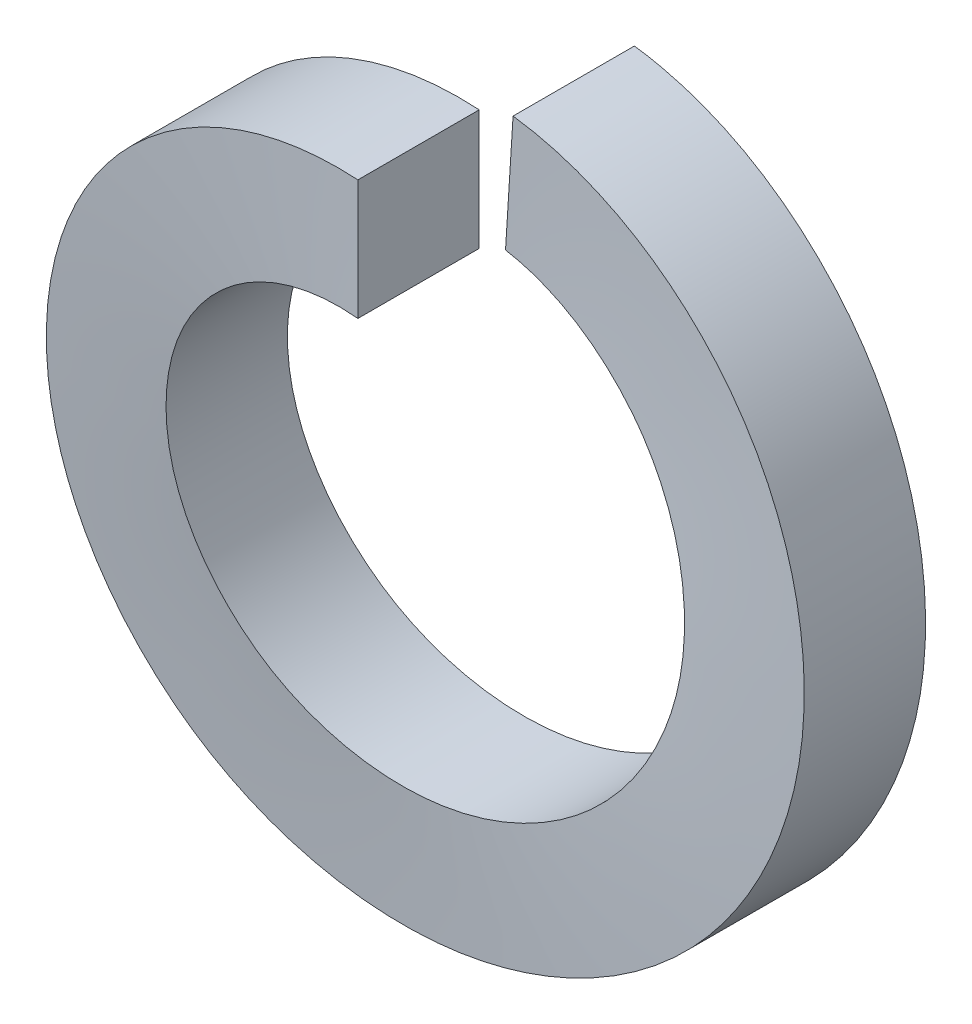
ISO-10303-21;
HEADER;
FILE_DESCRIPTION(('STEP AP214'),'2;1');
FILE_NAME('part.step','',(''),(''),'','','');
FILE_SCHEMA(('AUTOMOTIVE_DESIGN { 1 0 10303 214 1 1 1 1 }'));
ENDSEC;
DATA;
#1=APPLICATION_CONTEXT('core data for automotive mechanical design processes');
#2=APPLICATION_PROTOCOL_DEFINITION('international standard','automotive_design',2000,#1);
#3=PRODUCT_CONTEXT('',#1,'mechanical');
#4=PRODUCT('Part','Part','',(#3));
#5=PRODUCT_RELATED_PRODUCT_CATEGORY('part','',(#4));
#6=PRODUCT_DEFINITION_FORMATION('','',#4);
#7=PRODUCT_DEFINITION_CONTEXT('part definition',#1,'design');
#8=PRODUCT_DEFINITION('design','',#6,#7);
#9=PRODUCT_DEFINITION_SHAPE('','',#8);
#10=(LENGTH_UNIT() NAMED_UNIT(*) SI_UNIT(.MILLI.,.METRE.));
#11=(NAMED_UNIT(*) PLANE_ANGLE_UNIT() SI_UNIT($,.RADIAN.));
#12=(NAMED_UNIT(*) SI_UNIT($,.STERADIAN.) SOLID_ANGLE_UNIT());
#13=UNCERTAINTY_MEASURE_WITH_UNIT(LENGTH_MEASURE(1.E-05),#10,'distance_accuracy_value','');
#14=(GEOMETRIC_REPRESENTATION_CONTEXT(3) GLOBAL_UNCERTAINTY_ASSIGNED_CONTEXT((#13)) GLOBAL_UNIT_ASSIGNED_CONTEXT((#10,
#11,#12)) REPRESENTATION_CONTEXT('',''));
#15=CARTESIAN_POINT('',(0.,0.,0.));
#16=DIRECTION('',(0.,0.,1.));
#17=DIRECTION('',(1.,0.,0.));
#18=AXIS2_PLACEMENT_3D('',#15,#16,#17);
#19=CARTESIAN_POINT('',(0.,2.80035,1.1938));
#20=DIRECTION('',(1.,0.,0.));
#21=DIRECTION('',(0.,0.,-1.));
#22=AXIS2_PLACEMENT_3D('',#19,#20,#21);
#23=PLANE('',#22);
#24=CARTESIAN_POINT('',(0.,3.3909,1.1938));
#25=CARTESIAN_POINT('',(0.,2.2098,1.1938));
#26=(BOUNDED_CURVE() B_SPLINE_CURVE(1,(#24,#25),.UNSPECIFIED.,.F.,
.F.) B_SPLINE_CURVE_WITH_KNOTS((2,2),(0.,1.),
.UNSPECIFIED.) CURVE() GEOMETRIC_REPRESENTATION_ITEM() RATIONAL_B_SPLINE_CURVE((1.,1.)) REPRESENTATION_ITEM(''));
#27=CARTESIAN_POINT('',(0.,3.3909,1.1938));
#28=VERTEX_POINT('',#27);
#29=CARTESIAN_POINT('',(0.,2.2098,1.1938));
#30=VERTEX_POINT('',#29);
#31=EDGE_CURVE('E52',#28,#30,#26,.T.);
#32=ORIENTED_EDGE('',*,*,#31,.T.);
#33=CARTESIAN_POINT('',(0.,2.2098,1.1938));
#34=CARTESIAN_POINT('',(0.,2.2098,0.));
#35=(BOUNDED_CURVE() B_SPLINE_CURVE(1,(#33,#34),.UNSPECIFIED.,.F.,
.F.) B_SPLINE_CURVE_WITH_KNOTS((2,2),(0.,1.),
.UNSPECIFIED.) CURVE() GEOMETRIC_REPRESENTATION_ITEM() RATIONAL_B_SPLINE_CURVE((1.,1.)) REPRESENTATION_ITEM(''));
#36=CARTESIAN_POINT('',(0.,2.2098,0.));
#37=VERTEX_POINT('',#36);
#38=EDGE_CURVE('E84',#30,#37,#35,.T.);
#39=ORIENTED_EDGE('',*,*,#38,.T.);
#40=CARTESIAN_POINT('',(0.,2.2098,0.));
#41=CARTESIAN_POINT('',(0.,3.3909,0.));
#42=(BOUNDED_CURVE() B_SPLINE_CURVE(1,(#40,#41),.UNSPECIFIED.,.F.,
.F.) B_SPLINE_CURVE_WITH_KNOTS((2,2),(0.,1.),
.UNSPECIFIED.) CURVE() GEOMETRIC_REPRESENTATION_ITEM() RATIONAL_B_SPLINE_CURVE((1.,1.)) REPRESENTATION_ITEM(''));
#43=CARTESIAN_POINT('',(0.,3.3909,0.));
#44=VERTEX_POINT('',#43);
#45=EDGE_CURVE('E87',#37,#44,#42,.T.);
#46=ORIENTED_EDGE('',*,*,#45,.T.);
#47=CARTESIAN_POINT('',(0.,3.3909,0.));
#48=CARTESIAN_POINT('',(0.,3.3909,1.1938));
#49=(BOUNDED_CURVE() B_SPLINE_CURVE(1,(#47,#48),.UNSPECIFIED.,.F.,
.F.) B_SPLINE_CURVE_WITH_KNOTS((2,2),(0.,1.),
.UNSPECIFIED.) CURVE() GEOMETRIC_REPRESENTATION_ITEM() RATIONAL_B_SPLINE_CURVE((1.,1.)) REPRESENTATION_ITEM(''));
#50=EDGE_CURVE('E67',#44,#28,#49,.T.);
#51=ORIENTED_EDGE('',*,*,#50,.T.);
#52=EDGE_LOOP('',(#32,#39,#46,#51));
#53=FACE_BOUND('',#52,.T.);
#54=ADVANCED_FACE('F41',(#53),#23,.T.);
#55=CARTESIAN_POINT('',(0.157318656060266,2.50013031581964,-0.119911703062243));
#56=DIRECTION('',(0.998026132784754,-0.0627999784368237,3.14172442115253E-05));
#57=DIRECTION('',(0.0627999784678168,0.998026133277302,0.));
#58=AXIS2_PLACEMENT_3D('',#55,#56,#57);
#59=PLANE('',#58);
#60=CARTESIAN_POINT('',(0.21294844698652,3.38420681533,-0.119911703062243));
#61=CARTESIAN_POINT('',(0.138775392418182,2.20543814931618,-0.119911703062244));
#62=(BOUNDED_CURVE() B_SPLINE_CURVE(1,(#60,#61),.UNSPECIFIED.,.F.,
.F.) B_SPLINE_CURVE_WITH_KNOTS((2,2),(0.,1.),
.UNSPECIFIED.) CURVE() GEOMETRIC_REPRESENTATION_ITEM() RATIONAL_B_SPLINE_CURVE((0.988587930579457,0.988587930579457)) REPRESENTATION_ITEM(''));
#63=CARTESIAN_POINT('',(0.138789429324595,2.20543726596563,-0.119910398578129));
#64=VERTEX_POINT('',#63);
#65=CARTESIAN_POINT('',(0.212948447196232,3.38420681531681,-0.119911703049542));
#66=VERTEX_POINT('',#65);
#67=EDGE_CURVE('E12',#64,#66,#62,.F.);
#68=ORIENTED_EDGE('',*,*,#67,.T.);
#69=CARTESIAN_POINT('',(0.212948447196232,3.38420681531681,-1.31371170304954));
#70=CARTESIAN_POINT('',(0.212948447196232,3.38420681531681,-0.119911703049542));
#71=(BOUNDED_CURVE() B_SPLINE_CURVE(1,(#69,#70),.UNSPECIFIED.,.F.,
.F.) B_SPLINE_CURVE_WITH_KNOTS((2,2),(0.,1.),
.UNSPECIFIED.) CURVE() GEOMETRIC_REPRESENTATION_ITEM() RATIONAL_B_SPLINE_CURVE((0.98858793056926,0.98858793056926)) REPRESENTATION_ITEM(''));
#72=CARTESIAN_POINT('',(0.212969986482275,3.38420545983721,-1.31371039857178));
#73=VERTEX_POINT('',#72);
#74=EDGE_CURVE('E129',#66,#73,#71,.F.);
#75=ORIENTED_EDGE('',*,*,#74,.T.);
#76=CARTESIAN_POINT('',(0.138803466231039,2.20543638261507,-1.31370909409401));
#77=CARTESIAN_POINT('',(0.212991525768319,3.38420410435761,-1.31370909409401));
#78=(BOUNDED_CURVE() B_SPLINE_CURVE(1,(#76,#77),.UNSPECIFIED.,.F.,
.F.) B_SPLINE_CURVE_WITH_KNOTS((2,2),(0.,1.),
.UNSPECIFIED.) CURVE() GEOMETRIC_REPRESENTATION_ITEM() RATIONAL_B_SPLINE_CURVE((0.988585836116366,0.988585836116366)) REPRESENTATION_ITEM(''));
#79=CARTESIAN_POINT('',(0.138803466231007,2.20543638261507,-1.31370909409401));
#80=VERTEX_POINT('',#79);
#81=EDGE_CURVE('E107',#73,#80,#78,.F.);
#82=ORIENTED_EDGE('',*,*,#81,.T.);
#83=CARTESIAN_POINT('',(0.138803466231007,2.20543638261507,-0.119909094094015));
#84=CARTESIAN_POINT('',(0.138803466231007,2.20543638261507,-1.31370909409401));
#85=(BOUNDED_CURVE() B_SPLINE_CURVE(1,(#83,#84),.UNSPECIFIED.,.F.,
.F.) B_SPLINE_CURVE_WITH_KNOTS((2,2),(0.,1.),
.UNSPECIFIED.) CURVE() GEOMETRIC_REPRESENTATION_ITEM() RATIONAL_B_SPLINE_CURVE((0.988585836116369,0.988585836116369)) REPRESENTATION_ITEM(''));
#86=EDGE_CURVE('E92',#80,#64,#85,.F.);
#87=ORIENTED_EDGE('',*,*,#86,.T.);
#88=EDGE_LOOP('',(#68,#75,#82,#87));
#89=FACE_BOUND('',#88,.T.);
#90=ADVANCED_FACE('F43',(#89),#59,.F.);
#91=CARTESIAN_POINT('',(0.,3.3909,1.1938));
#92=CARTESIAN_POINT('',(-1.40455676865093,3.3909,1.11089722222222));
#93=CARTESIAN_POINT('',(-2.39772838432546,2.39772838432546,1.02799444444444));
#94=CARTESIAN_POINT('',(-3.3909,1.40455676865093,0.945091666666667));
#95=CARTESIAN_POINT('',(-3.3909,0.,0.862188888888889));
#96=CARTESIAN_POINT('',(-3.3909,-1.40455676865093,0.779286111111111));
#97=CARTESIAN_POINT('',(-2.39772838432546,-2.39772838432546,0.696383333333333));
#98=CARTESIAN_POINT('',(-1.40455676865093,-3.3909,0.613480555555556));
#99=CARTESIAN_POINT('',(0.,-3.3909,0.530577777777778));
#100=CARTESIAN_POINT('',(1.40455676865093,-3.3909,0.447675));
#101=CARTESIAN_POINT('',(2.39772838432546,-2.39772838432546,0.364772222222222));
#102=CARTESIAN_POINT('',(3.3909,-1.40455676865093,0.281869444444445));
#103=CARTESIAN_POINT('',(3.3909,0.,0.198966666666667));
#104=CARTESIAN_POINT('',(3.3909,1.40455676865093,0.116063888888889));
#105=CARTESIAN_POINT('',(2.39772838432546,2.39772838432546,0.0331611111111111));
#106=CARTESIAN_POINT('',(1.49171531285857,3.30374145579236,-0.0424663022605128));
#107=CARTESIAN_POINT('',(0.21294844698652,3.38420681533,-0.119911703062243));
#108=CARTESIAN_POINT('',(0.,2.2098,1.1938));
#109=CARTESIAN_POINT('',(-0.915329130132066,2.2098,1.11089722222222));
#110=CARTESIAN_POINT('',(-1.56256456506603,1.56256456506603,1.02799444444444));
#111=CARTESIAN_POINT('',(-2.2098,0.915329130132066,0.945091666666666));
#112=CARTESIAN_POINT('',(-2.2098,0.,0.862188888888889));
#113=CARTESIAN_POINT('',(-2.2098,-0.915329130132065,0.779286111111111));
#114=CARTESIAN_POINT('',(-1.56256456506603,-1.56256456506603,0.696383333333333));
#115=CARTESIAN_POINT('',(-0.915329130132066,-2.2098,0.613480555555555));
#116=CARTESIAN_POINT('',(0.,-2.2098,0.530577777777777));
#117=CARTESIAN_POINT('',(0.915329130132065,-2.2098,0.447675));
#118=CARTESIAN_POINT('',(1.56256456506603,-1.56256456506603,0.364772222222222));
#119=CARTESIAN_POINT('',(2.2098,-0.915329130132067,0.281869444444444));
#120=CARTESIAN_POINT('',(2.2098,0.,0.198966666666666));
#121=CARTESIAN_POINT('',(2.2098,0.915329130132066,0.116063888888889));
#122=CARTESIAN_POINT('',(1.56256456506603,1.56256456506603,0.0331611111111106));
#123=CARTESIAN_POINT('',(0.972129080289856,2.15300004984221,-0.0424663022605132));
#124=CARTESIAN_POINT('',(0.138775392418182,2.20543814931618,-0.119911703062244));
#125=(BOUNDED_SURFACE() B_SPLINE_SURFACE(1,2,((#91,#92,#93,#94,#95,#96,#97,#98,#99,#100,#101,
#102,#103,#104,#105,#106,#107),(#108,#109,#110,#111,#112,#113,#114,#115,#116,#117,#118,#119,
#120,#121,#122,#123,#124)),.UNSPECIFIED.,.F.,.F.,.F.) B_SPLINE_SURFACE_WITH_KNOTS((2,2),(3,2,2,
2,2,2,2,2,3),(0.,1.),(0.,0.125,0.25,0.375,0.5,0.625,0.75,0.875,0.989797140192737),
.UNSPECIFIED.) GEOMETRIC_REPRESENTATION_ITEM() RATIONAL_B_SPLINE_SURFACE(((1.,0.923879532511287,
1.,0.923879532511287,1.,0.923879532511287,1.,0.923879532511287,1.,0.923879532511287,1.,
0.923879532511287,1.,0.923879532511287,1.,0.930092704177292,0.988587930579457),(1.,
0.923879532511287,1.,0.923879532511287,1.,0.923879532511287,1.,0.923879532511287,1.,
0.923879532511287,1.,0.923879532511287,1.,0.923879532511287,1.,0.930092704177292,0.988587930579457))) REPRESENTATION_ITEM('') SURFACE());
#126=CARTESIAN_POINT('',(0.,3.3909,1.1938));
#127=CARTESIAN_POINT('',(-1.40455676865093,3.3909,1.11089722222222));
#128=CARTESIAN_POINT('',(-2.39772838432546,2.39772838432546,1.02799444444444));
#129=CARTESIAN_POINT('',(-3.3909,1.40455676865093,0.945091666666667));
#130=CARTESIAN_POINT('',(-3.3909,0.,0.862188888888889));
#131=CARTESIAN_POINT('',(-3.3909,-1.40455676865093,0.779286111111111));
#132=CARTESIAN_POINT('',(-2.39772838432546,-2.39772838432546,0.696383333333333));
#133=CARTESIAN_POINT('',(-1.40455676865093,-3.3909,0.613480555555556));
#134=CARTESIAN_POINT('',(0.,-3.3909,0.530577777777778));
#135=CARTESIAN_POINT('',(1.40455676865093,-3.3909,0.447675));
#136=CARTESIAN_POINT('',(2.39772838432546,-2.39772838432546,0.364772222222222));
#137=CARTESIAN_POINT('',(3.3909,-1.40455676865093,0.281869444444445));
#138=CARTESIAN_POINT('',(3.3909,0.,0.198966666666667));
#139=CARTESIAN_POINT('',(3.3909,1.40455676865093,0.116063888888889));
#140=CARTESIAN_POINT('',(2.39772838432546,2.39772838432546,0.0331611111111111));
#141=CARTESIAN_POINT('',(1.49171531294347,3.30374145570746,-0.0424663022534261));
#142=CARTESIAN_POINT('',(0.212948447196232,3.38420681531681,-0.119911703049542));
#143=(BOUNDED_CURVE() B_SPLINE_CURVE(2,(#126,#127,#128,#129,#130,#131,#132,#133,#134,#135,#136,
#137,#138,#139,#140,#141,#142),.UNSPECIFIED.,.F.,.F.) B_SPLINE_CURVE_WITH_KNOTS((3,2,2,2,2,2,2,
2,3),(0.,0.125,0.25,0.375,0.5,0.625,0.75,0.875,0.989797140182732),
.UNSPECIFIED.) CURVE() GEOMETRIC_REPRESENTATION_ITEM() RATIONAL_B_SPLINE_CURVE((1.,
0.923879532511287,1.,0.923879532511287,1.,0.923879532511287,1.,0.923879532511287,1.,
0.923879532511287,1.,0.923879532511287,1.,0.923879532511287,1.,0.930092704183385,0.98858793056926)) REPRESENTATION_ITEM(''));
#144=EDGE_CURVE('E59',#28,#66,#143,.T.);
#145=CARTESIAN_POINT('',(0.,2.2098,1.1938));
#146=CARTESIAN_POINT('',(-0.0311287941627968,2.20980041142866,1.19098063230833));
#147=CARTESIAN_POINT('',(-0.0622553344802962,2.20914226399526,1.18813676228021));
#148=CARTESIAN_POINT('',(-0.124687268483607,2.20650227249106,1.18238316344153));
#149=CARTESIAN_POINT('',(-0.15599220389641,2.20451031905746,1.17947309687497));
#150=CARTESIAN_POINT('',(-0.218696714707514,2.19917818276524,1.17359381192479));
#151=CARTESIAN_POINT('',(-0.250095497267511,2.19582896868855,1.17062432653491));
#152=CARTESIAN_POINT('',(-0.312900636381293,2.1877653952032,1.16463345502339));
#153=CARTESIAN_POINT('',(-0.344305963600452,2.18304316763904,1.16161186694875));
#154=CARTESIAN_POINT('',(-0.407034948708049,2.17222387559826,1.15552450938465));
#155=CARTESIAN_POINT('',(-0.438357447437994,2.16612017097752,1.15245859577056));
#156=CARTESIAN_POINT('',(-0.500830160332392,2.15253596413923,1.14629072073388));
#157=CARTESIAN_POINT('',(-0.531979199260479,2.14505009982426,1.14318866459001));
#158=CARTESIAN_POINT('',(-0.594013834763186,2.12870748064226,1.13695698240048));
#159=CARTESIAN_POINT('',(-0.624898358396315,2.11984667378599,1.13382730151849));
#160=CARTESIAN_POINT('',(-0.686313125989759,2.10076804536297,1.12754911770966));
#161=CARTESIAN_POINT('',(-0.716842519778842,2.09054749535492,1.12440058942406));
#162=CARTESIAN_POINT('',(-0.777457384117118,2.06877119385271,1.11809364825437));
#163=CARTESIAN_POINT('',(-0.80754234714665,2.05721403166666,1.11493522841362));
#164=CARTESIAN_POINT('',(-0.867180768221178,2.03279411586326,1.10861754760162));
#165=CARTESIAN_POINT('',(-0.896734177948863,2.0199312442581,1.10545828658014));
#166=CARTESIAN_POINT('',(-0.955224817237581,1.99293706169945,1.09914798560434));
#167=CARTESIAN_POINT('',(-0.984162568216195,1.97880688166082,1.09599694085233));
#168=CARTESIAN_POINT('',(-1.04134092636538,1.94932241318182,1.08971207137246));
#169=CARTESIAN_POINT('',(-1.06958272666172,1.93397044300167,1.08657822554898));
#170=CARTESIAN_POINT('',(-1.12529267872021,1.90209344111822,1.08033658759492));
#171=CARTESIAN_POINT('',(-1.15276278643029,1.88557183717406,1.07722874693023));
#172=CARTESIAN_POINT('',(-1.20685798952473,1.85141277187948,1.07104776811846));
#173=CARTESIAN_POINT('',(-1.23348588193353,1.83377975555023,1.06797454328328));
#174=CARTESIAN_POINT('',(-1.28583101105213,1.79746060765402,1.06187094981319));
#175=CARTESIAN_POINT('',(-1.31155194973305,1.77877983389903,1.05884044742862));
#176=CARTESIAN_POINT('',(-1.36202380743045,1.74043270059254,1.05283074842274));
#177=CARTESIAN_POINT('',(-1.38677938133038,1.72077249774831,1.04985135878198));
#178=CARTESIAN_POINT('',(-1.4352676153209,1.68053827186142,1.04394937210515));
#179=CARTESIAN_POINT('',(-1.45900591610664,1.65997108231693,1.04102653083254));
#180=CARTESIAN_POINT('',(-1.50541425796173,1.61799738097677,1.03525191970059));
#181=CARTESIAN_POINT('',(-1.5280909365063,1.59659825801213,1.03239978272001));
#182=CARTESIAN_POINT('',(-1.57246024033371,1.55291703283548,1.0267300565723));
#183=CARTESIAN_POINT('',(-1.59415535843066,1.53063747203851,1.02391239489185));
#184=CARTESIAN_POINT('',(-1.63674232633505,1.48501575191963,1.01819312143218));
#185=CARTESIAN_POINT('',(-1.65762688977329,1.4616668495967,1.01529103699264));
#186=CARTESIAN_POINT('',(-1.6985239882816,1.41394012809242,1.00943123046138));
#187=CARTESIAN_POINT('',(-1.71852947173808,1.38955629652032,1.00647326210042));
#188=CARTESIAN_POINT('',(-1.7575937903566,1.33980832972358,1.00050274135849));
#189=CARTESIAN_POINT('',(-1.77664620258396,1.31443917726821,0.997489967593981));
#190=CARTESIAN_POINT('',(-1.81373381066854,1.26277551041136,0.991419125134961));
#191=CARTESIAN_POINT('',(-1.83176333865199,1.2364769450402,0.98836090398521));
#192=CARTESIAN_POINT('',(-1.86673879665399,1.1830160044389,0.982206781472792));
#193=CARTESIAN_POINT('',(-1.88367993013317,1.1558505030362,0.979110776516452));
#194=CARTESIAN_POINT('',(-1.91641731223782,1.10072325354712,0.972889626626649));
#195=CARTESIAN_POINT('',(-1.93220974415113,1.07275924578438,0.969764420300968));
#196=CARTESIAN_POINT('',(-1.96259416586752,1.0161080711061,0.963493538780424));
#197=CARTESIAN_POINT('',(-1.97718341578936,0.987419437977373,0.960347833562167));
#198=CARTESIAN_POINT('',(-2.00511227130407,0.929396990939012,0.954044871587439));
#199=CARTESIAN_POINT('',(-2.01845029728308,0.900062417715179,0.950887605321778));
#200=CARTESIAN_POINT('',(-2.04383438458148,0.840830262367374,0.944570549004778));
#201=CARTESIAN_POINT('',(-2.05588009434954,0.810932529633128,0.941410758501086));
#202=CARTESIAN_POINT('',(-2.07864454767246,0.750659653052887,0.935097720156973));
#203=CARTESIAN_POINT('',(-2.08936421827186,0.720284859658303,0.931944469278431));
#204=CARTESIAN_POINT('',(-2.10944924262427,0.659146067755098,0.925653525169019));
#205=CARTESIAN_POINT('',(-2.11881683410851,0.628382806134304,0.922515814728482));
#206=CARTESIAN_POINT('',(-2.13617822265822,0.566557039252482,0.916264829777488));
#207=CARTESIAN_POINT('',(-2.144175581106,0.535495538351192,0.913151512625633));
#208=CARTESIAN_POINT('',(-2.15878500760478,0.47316413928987,0.906957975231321));
#209=CARTESIAN_POINT('',(-2.16540195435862,0.441895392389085,0.903877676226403));
#210=CARTESIAN_POINT('',(-2.17724703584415,0.379240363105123,0.897758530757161));
#211=CARTESIAN_POINT('',(-2.18248134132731,0.347855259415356,0.894719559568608));
#212=CARTESIAN_POINT('',(-2.19156547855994,0.285057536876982,0.888691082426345));
#213=CARTESIAN_POINT('',(-2.1954227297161,0.253646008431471,0.885701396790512));
#214=CARTESIAN_POINT('',(-2.20176471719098,0.19088380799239,0.879778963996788));
#215=CARTESIAN_POINT('',(-2.20425806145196,0.159534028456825,0.876845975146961));
#216=CARTESIAN_POINT('',(-2.20789154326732,0.0969812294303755,0.871044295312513));
#217=CARTESIAN_POINT('',(-2.20904140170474,0.0657788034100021,0.868175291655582));
#218=CARTESIAN_POINT('',(-2.21001559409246,0.003499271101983,0.862497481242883));
#219=CARTESIAN_POINT('',(-2.20984628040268,-0.027577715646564,0.859688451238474));
#220=CARTESIAN_POINT('',(-2.20819202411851,-0.0899031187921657,0.853990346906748));
#221=CARTESIAN_POINT('',(-2.20669812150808,-0.121151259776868,0.851100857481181));
#222=CARTESIAN_POINT('',(-2.20237033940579,-0.183774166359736,0.845264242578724));
#223=CARTESIAN_POINT('',(-2.19952701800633,-0.215148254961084,0.842316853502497));
#224=CARTESIAN_POINT('',(-2.19248067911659,-0.27793651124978,0.836366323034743));
#225=CARTESIAN_POINT('',(-2.18826935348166,-0.309349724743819,0.833362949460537));
#226=CARTESIAN_POINT('',(-2.17847457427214,-0.372127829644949,0.827309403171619));
#227=CARTESIAN_POINT('',(-2.1728840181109,-0.403491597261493,0.824259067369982));
#228=CARTESIAN_POINT('',(-2.16032592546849,-0.46608057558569,0.818119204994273));
#229=CARTESIAN_POINT('',(-2.1533525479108,-0.497304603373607,0.815029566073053));
#230=CARTESIAN_POINT('',(-2.13803178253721,-0.559523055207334,0.808819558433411));
#231=CARTESIAN_POINT('',(-2.12967985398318,-0.590516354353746,0.805699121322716));
#232=CARTESIAN_POINT('',(-2.11161290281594,-0.652182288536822,0.799436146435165));
#233=CARTESIAN_POINT('',(-2.10189466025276,-0.682853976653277,0.796293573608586));
#234=CARTESIAN_POINT('',(-2.0811139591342,-0.743786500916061,0.789995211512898));
#235=CARTESIAN_POINT('',(-2.07004960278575,-0.774046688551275,0.786839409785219));
#236=CARTESIAN_POINT('',(-2.04660341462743,-0.834067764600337,0.780523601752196));
#237=CARTESIAN_POINT('',(-2.03422098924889,-0.863828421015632,0.777363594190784));
#238=CARTESIAN_POINT('',(-2.00817305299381,-0.922764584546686,0.771048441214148));
#239=CARTESIAN_POINT('',(-1.99450821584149,-0.951940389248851,0.767893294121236));
#240=CARTESIAN_POINT('',(-1.96593717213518,-1.00962441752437,0.761596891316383));
#241=CARTESIAN_POINT('',(-1.95103285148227,-1.03813357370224,0.758455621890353));
#242=CARTESIAN_POINT('',(-1.92003145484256,-1.09440606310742,0.752195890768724));
#243=CARTESIAN_POINT('',(-1.903937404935,-1.12217105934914,0.749077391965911));
#244=CARTESIAN_POINT('',(-1.87061154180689,-1.17688188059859,0.7428718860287));
#245=CARTESIAN_POINT('',(-1.85338380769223,-1.20383018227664,0.739784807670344));
#246=CARTESIAN_POINT('',(-1.81785133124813,-1.25683979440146,0.733650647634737));
#247=CARTESIAN_POINT('',(-1.79955162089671,-1.28290446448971,0.730603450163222));
#248=CARTESIAN_POINT('',(-1.76194106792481,-1.3340850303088,0.724556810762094));
#249=CARTESIAN_POINT('',(-1.74263609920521,-1.35920522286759,0.721557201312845));
#250=CARTESIAN_POINT('',(-1.70308517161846,-1.40844163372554,0.715614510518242));
#251=CARTESIAN_POINT('',(-1.68284581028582,-1.43256312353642,0.712671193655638));
#252=CARTESIAN_POINT('',(-1.64150019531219,-1.47975345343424,0.706844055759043));
#253=CARTESIAN_POINT('',(-1.62040113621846,-1.50282856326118,0.703959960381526));
#254=CARTESIAN_POINT('',(-1.57737588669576,-1.54792319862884,0.698268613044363));
#255=CARTESIAN_POINT('',(-1.55545578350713,-1.56994848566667,0.695460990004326));
#256=CARTESIAN_POINT('',(-1.51058665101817,-1.61317073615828,0.689778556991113));
#257=CARTESIAN_POINT('',(-1.48763262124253,-1.63436247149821,0.686903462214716));
#258=CARTESIAN_POINT('',(-1.44067975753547,-1.67590199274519,0.681091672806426));
#259=CARTESIAN_POINT('',(-1.41667454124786,-1.69624252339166,0.678154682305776));
#260=CARTESIAN_POINT('',(-1.36766503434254,-1.73600416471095,0.672224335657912));
#261=CARTESIAN_POINT('',(-1.34265535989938,-1.7554186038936,0.669230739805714));
#262=CARTESIAN_POINT('',(-1.29168946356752,-1.79325601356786,0.663195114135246));
#263=CARTESIAN_POINT('',(-1.2657288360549,-1.81167302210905,0.660152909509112));
#264=CARTESIAN_POINT('',(-1.21292020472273,-1.84744751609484,0.654027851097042));
#265=CARTESIAN_POINT('',(-1.18606873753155,-1.86479986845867,0.650944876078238));
#266=CARTESIAN_POINT('',(-1.13154380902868,-1.89838179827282,0.644746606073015));
#267=CARTESIAN_POINT('',(-1.1038677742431,-1.91460718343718,0.641631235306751));
#268=CARTESIAN_POINT('',(-1.04776481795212,-1.9458774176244,0.635376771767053));
#269=CARTESIAN_POINT('',(-1.01933614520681,-1.96091911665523,0.63223763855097));
#270=CARTESIAN_POINT('',(-0.961804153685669,-1.98977035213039,0.625944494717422));
#271=CARTESIAN_POINT('',(-0.932699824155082,-2.0035778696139,0.622790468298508));
#272=CARTESIAN_POINT('',(-0.873897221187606,-2.02991581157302,0.6164765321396));
#273=CARTESIAN_POINT('',(-0.844198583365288,-2.04244542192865,0.613316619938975));
#274=CARTESIAN_POINT('',(-0.784291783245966,-2.06618978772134,0.606999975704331));
#275=CARTESIAN_POINT('',(-0.75408379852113,-2.07740499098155,0.603843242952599));
#276=CARTESIAN_POINT('',(-0.693245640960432,-2.09849032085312,0.597541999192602));
#277=CARTESIAN_POINT('',(-0.662616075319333,-2.10836219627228,0.594397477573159));
#278=CARTESIAN_POINT('',(-0.601024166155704,-2.12673845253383,0.588129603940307));
#279=CARTESIAN_POINT('',(-0.570062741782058,-2.13524590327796,0.585006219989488));
#280=CARTESIAN_POINT('',(-0.507897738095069,-2.15087884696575,0.578789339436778));
#281=CARTESIAN_POINT('',(-0.476695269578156,-2.15800873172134,0.575695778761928));
#282=CARTESIAN_POINT('',(-0.414139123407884,-2.17088007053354,0.569547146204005));
#283=CARTESIAN_POINT('',(-0.382786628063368,-2.17662721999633,0.566491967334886));
#284=CARTESIAN_POINT('',(-0.320020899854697,-2.18673453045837,0.560427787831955));
#285=CARTESIAN_POINT('',(-0.288608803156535,-2.19110165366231,0.55741863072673));
#286=CARTESIAN_POINT('',(-0.22581279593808,-2.19845807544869,0.55145587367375));
#287=CARTESIAN_POINT('',(-0.194429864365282,-2.20145554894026,0.548502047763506));
#288=CARTESIAN_POINT('',(-0.131779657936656,-2.20608929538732,0.542651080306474));
#289=CARTESIAN_POINT('',(-0.100513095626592,-2.20773488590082,0.53975368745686));
#290=CARTESIAN_POINT('',(-0.0381601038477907,-2.20968901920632,0.534043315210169));
#291=CARTESIAN_POINT('',(-0.00707401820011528,-2.21000719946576,0.531229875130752));
#292=CARTESIAN_POINT('',(0.0551928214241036,-2.20933084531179,0.525557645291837));
#293=CARTESIAN_POINT('',(0.0863735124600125,-2.20833157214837,0.522698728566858));
#294=CARTESIAN_POINT('',(0.148892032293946,-2.20500212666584,0.516913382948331));
#295=CARTESIAN_POINT('',(0.180229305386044,-2.202662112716,0.513986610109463));
#296=CARTESIAN_POINT('',(0.242976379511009,-2.19662886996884,0.508076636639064));
#297=CARTESIAN_POINT('',(0.27438531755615,-2.19292690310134,0.505093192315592));
#298=CARTESIAN_POINT('',(0.337187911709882,-2.18415458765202,0.499076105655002));
#299=CARTESIAN_POINT('',(0.3685804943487,-2.17907668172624,0.496042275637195));
#300=CARTESIAN_POINT('',(0.431260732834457,-2.16754478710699,0.489932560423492));
#301=CARTESIAN_POINT('',(0.46254721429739,-2.16108448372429,0.486856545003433));
#302=CARTESIAN_POINT('',(0.524924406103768,-2.14678784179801,0.480670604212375));
#303=CARTESIAN_POINT('',(0.556013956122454,-2.13894647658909,0.477560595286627));
#304=CARTESIAN_POINT('',(0.617906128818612,-2.12189567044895,0.471315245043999));
#305=CARTESIAN_POINT('',(0.648707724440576,-2.11268251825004,0.468179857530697));
#306=CARTESIAN_POINT('',(0.709933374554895,-2.09290406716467,0.461892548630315));
#307=CARTESIAN_POINT('',(0.740356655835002,-2.08233638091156,0.458740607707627));
#308=CARTESIAN_POINT('',(0.800736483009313,-2.05987270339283,0.452429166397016));
#309=CARTESIAN_POINT('',(0.830692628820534,-2.04797563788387,0.449269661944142));
#310=CARTESIAN_POINT('',(0.890051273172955,-2.02288478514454,0.442952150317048));
#311=CARTESIAN_POINT('',(0.919453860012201,-2.00969120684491,0.43979414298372));
#312=CARTESIAN_POINT('',(0.977621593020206,-1.98204637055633,0.433488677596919));
#313=CARTESIAN_POINT('',(1.00638742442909,-1.96759655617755,0.430341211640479));
#314=CARTESIAN_POINT('',(1.063201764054,-1.93748535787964,0.424065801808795));
#315=CARTESIAN_POINT('',(1.09125165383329,-1.9218265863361,0.420937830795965));
#316=CARTESIAN_POINT('',(1.14655886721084,-1.88935016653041,0.4147101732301));
#317=CARTESIAN_POINT('',(1.17381835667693,-1.87253621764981,0.411610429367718));
#318=CARTESIAN_POINT('',(1.22747483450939,-1.83780813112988,0.405447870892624));
#319=CARTESIAN_POINT('',(1.25387484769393,-1.81989868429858,0.402384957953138));
#320=CARTESIAN_POINT('',(1.30574827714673,-1.78304367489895,0.396303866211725));
#321=CARTESIAN_POINT('',(1.33122563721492,-1.76410368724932,0.393285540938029));
#322=CARTESIAN_POINT('',(1.38119613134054,-1.72525618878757,0.387302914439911));
#323=CARTESIAN_POINT('',(1.40569417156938,-1.70535502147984,0.384338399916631));
#324=CARTESIAN_POINT('',(1.45365467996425,-1.66465808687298,0.37846524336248));
#325=CARTESIAN_POINT('',(1.47712304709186,-1.64386930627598,0.375556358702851));
#326=CARTESIAN_POINT('',(1.5229824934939,-1.60147057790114,0.369821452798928));
#327=CARTESIAN_POINT('',(1.54538042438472,-1.57986810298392,0.366994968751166));
#328=CARTESIAN_POINT('',(1.58926806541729,-1.53571258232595,0.361327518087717));
#329=CARTESIAN_POINT('',(1.61075672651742,-1.5131584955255,0.358486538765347));
#330=CARTESIAN_POINT('',(1.65291799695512,-1.46699108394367,0.352729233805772));
#331=CARTESIAN_POINT('',(1.67358316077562,-1.44337101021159,0.34981249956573));
#332=CARTESIAN_POINT('',(1.71402188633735,-1.39511384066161,0.343923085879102));
#333=CARTESIAN_POINT('',(1.7337885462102,-1.37047099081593,0.340950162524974));
#334=CARTESIAN_POINT('',(1.77235666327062,-1.32021850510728,0.334952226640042));
#335=CARTESIAN_POINT('',(1.79115188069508,-1.29460410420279,0.331927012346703));
#336=CARTESIAN_POINT('',(1.82770753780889,-1.2424652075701,0.325833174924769));
#337=CARTESIAN_POINT('',(1.84546252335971,-1.21593690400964,0.322764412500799));
#338=CARTESIAN_POINT('',(1.87987258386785,-1.16203334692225,0.316591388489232));
#339=CARTESIAN_POINT('',(1.8965231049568,-1.13465519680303,0.313487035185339));
#340=CARTESIAN_POINT('',(1.92866436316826,-1.07912098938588,0.30725139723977));
#341=CARTESIAN_POINT('',(1.94415155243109,-1.05096288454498,0.304120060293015));
#342=CARTESIAN_POINT('',(1.97391217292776,-0.993943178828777,0.29783920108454));
#343=CARTESIAN_POINT('',(1.9881831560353,-0.965080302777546,0.294689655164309));
#344=CARTESIAN_POINT('',(2.0154638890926,-0.906730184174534,0.288381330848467));
#345=CARTESIAN_POINT('',(2.02847237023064,-0.877242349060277,0.285222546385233));
#346=CARTESIAN_POINT('',(2.05318762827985,-0.817725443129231,0.278904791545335));
#347=CARTESIAN_POINT('',(2.06489437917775,-0.787696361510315,0.275745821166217));
#348=CARTESIAN_POINT('',(2.08697312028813,-0.72718331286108,0.269436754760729));
#349=CARTESIAN_POINT('',(2.09734637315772,-0.696699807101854,0.266286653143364));
#350=CARTESIAN_POINT('',(2.11673278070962,-0.635366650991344,0.260004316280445));
#351=CARTESIAN_POINT('',(2.12574851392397,-0.604517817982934,0.256872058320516));
#352=CARTESIAN_POINT('',(2.14240245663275,-0.542544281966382,0.25063422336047));
#353=CARTESIAN_POINT('',(2.15004456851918,-0.511420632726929,0.247528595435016));
#354=CARTESIAN_POINT('',(2.16394183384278,-0.448988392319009,0.241352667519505));
#355=CARTESIAN_POINT('',(2.17020220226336,-0.417680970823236,0.238282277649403));
#356=CARTESIAN_POINT('',(2.18133450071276,-0.354971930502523,0.232184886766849));
#357=CARTESIAN_POINT('',(2.18621292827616,-0.32357147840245,0.229157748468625));
#358=CARTESIAN_POINT('',(2.19458767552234,-0.26076597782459,0.223155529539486));
#359=CARTESIAN_POINT('',(2.19809172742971,-0.229361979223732,0.220180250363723));
#360=CARTESIAN_POINT('',(2.20373160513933,-0.166637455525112,0.214286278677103));
#361=CARTESIAN_POINT('',(2.20587633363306,-0.13531775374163,0.211367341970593));
#362=CARTESIAN_POINT('',(2.20881867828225,-0.0728460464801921,0.205603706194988));
#363=CARTESIAN_POINT('',(2.20962628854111,-0.0416945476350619,0.202758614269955));
#364=CARTESIAN_POINT('',(2.20992319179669,0.0205627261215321,0.197090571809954));
#365=CARTESIAN_POINT('',(2.20941474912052,0.0516684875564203,0.194267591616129));
#366=CARTESIAN_POINT('',(2.20707675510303,0.114063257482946,0.188538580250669));
#367=CARTESIAN_POINT('',(2.20523711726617,0.145351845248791,0.18563207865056));
#368=CARTESIAN_POINT('',(2.20021210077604,0.208033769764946,0.179763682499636));
#369=CARTESIAN_POINT('',(2.19701756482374,0.239426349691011,0.176801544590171));
#370=CARTESIAN_POINT('',(2.1892648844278,0.302228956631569,0.170823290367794));
#371=CARTESIAN_POINT('',(2.18469873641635,0.333637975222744,0.16780695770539));
#372=CARTESIAN_POINT('',(2.17419232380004,0.396384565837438,0.161729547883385));
#373=CARTESIAN_POINT('',(2.16824527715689,0.42772098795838,0.158668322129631));
#374=CARTESIAN_POINT('',(2.15497421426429,0.490231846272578,0.152508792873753));
#375=CARTESIAN_POINT('',(2.14764468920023,0.521405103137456,0.149410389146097));
#376=CARTESIAN_POINT('',(2.13161368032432,0.583498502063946,0.143185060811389));
#377=CARTESIAN_POINT('',(2.12290799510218,0.614417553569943,0.140058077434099));
#378=CARTESIAN_POINT('',(2.10413763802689,0.675911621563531,0.133784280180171));
#379=CARTESIAN_POINT('',(2.09407008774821,0.706485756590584,0.130637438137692));
#380=CARTESIAN_POINT('',(2.07259691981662,0.767200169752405,0.124332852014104));
#381=CARTESIAN_POINT('',(2.06118974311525,0.797339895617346,0.121175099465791));
#382=CARTESIAN_POINT('',(2.03706605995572,0.857097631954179,0.114857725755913));
#383=CARTESIAN_POINT('',(2.02434929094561,0.886715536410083,0.111698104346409));
#384=CARTESIAN_POINT('',(1.99764273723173,0.945344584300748,0.105386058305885));
#385=CARTESIAN_POINT('',(1.98365394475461,0.974356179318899,0.102233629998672));
#386=CARTESIAN_POINT('',(1.95444688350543,1.03169118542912,0.0959449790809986));
#387=CARTESIAN_POINT('',(1.93923080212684,1.06001570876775,0.0928087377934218));
#388=CARTESIAN_POINT('',(1.9076194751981,1.1158995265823,0.0865613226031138));
#389=CARTESIAN_POINT('',(1.89122753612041,1.14346068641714,0.0834501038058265));
#390=CARTESIAN_POINT('',(1.85732103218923,1.19774579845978,0.0772613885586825));
#391=CARTESIAN_POINT('',(1.83981080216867,1.224472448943,0.0741838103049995));
#392=CARTESIAN_POINT('',(1.80372986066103,1.27702222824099,0.0680706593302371));
#393=CARTESIAN_POINT('',(1.78516440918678,1.3028489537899,0.0650349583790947));
#394=CARTESIAN_POINT('',(1.7470400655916,1.35353877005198,0.0590137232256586));
#395=CARTESIAN_POINT('',(1.72748724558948,1.37840640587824,0.0560280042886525));
#396=CARTESIAN_POINT('',(1.68745942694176,1.42712445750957,0.0501135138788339));
#397=CARTESIAN_POINT('',(1.66699119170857,1.45098040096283,0.0471844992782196));
#398=CARTESIAN_POINT('',(1.62520700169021,1.49762863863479,0.0413931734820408));
#399=CARTESIAN_POINT('',(1.6038983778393,1.52042745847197,0.0385305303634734));
#400=CARTESIAN_POINT('',(1.56042062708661,1.56501406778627,0.0328565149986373));
#401=CARTESIAN_POINT('',(1.53825534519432,1.58680558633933,0.0300449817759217));
#402=CARTESIAN_POINT('',(1.49286756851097,1.62958339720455,0.0243392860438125));
#403=CARTESIAN_POINT('',(1.46963863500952,1.65056279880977,0.0214446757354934));
#404=CARTESIAN_POINT('',(1.42214684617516,1.69165816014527,0.0155988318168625));
#405=CARTESIAN_POINT('',(1.39787786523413,1.71176700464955,0.0126473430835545));
#406=CARTESIAN_POINT('',(1.34835378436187,1.75104629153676,0.00668900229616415));
#407=CARTESIAN_POINT('',(1.32309355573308,1.77021023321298,0.00368192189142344));
#408=CARTESIAN_POINT('',(1.27164117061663,1.80752870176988,-0.00237843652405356));
#409=CARTESIAN_POINT('',(1.24544485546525,1.8256774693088,-0.00543187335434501));
#410=CARTESIAN_POINT('',(1.19218113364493,1.86089868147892,-0.0115773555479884));
#411=CARTESIAN_POINT('',(1.16511049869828,1.87796622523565,-0.0146695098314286));
#412=CARTESIAN_POINT('',(1.11016504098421,1.91096309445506,-0.0208839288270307));
#413=CARTESIAN_POINT('',(1.0822878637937,1.92688848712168,-0.024006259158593));
#414=CARTESIAN_POINT('',(1.02580181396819,1.95754481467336,-0.0302723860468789));
#415=CARTESIAN_POINT('',(0.997191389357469,1.97227288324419,-0.0334162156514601));
#416=CARTESIAN_POINT('',(0.939316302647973,2.00048461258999,-0.0397164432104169));
#417=CARTESIAN_POINT('',(0.91005080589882,2.0139665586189,-0.0428728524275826));
#418=CARTESIAN_POINT('',(0.850947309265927,2.03964291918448,-0.0491892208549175));
#419=CARTESIAN_POINT('',(0.821109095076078,2.0518368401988,-0.0523491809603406));
#420=CARTESIAN_POINT('',(0.7609454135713,2.07490130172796,-0.0586635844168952));
#421=CARTESIAN_POINT('',(0.730620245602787,2.0857726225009,-0.0618180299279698));
#422=CARTESIAN_POINT('',(0.669570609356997,2.10616365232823,-0.0681123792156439));
#423=CARTESIAN_POINT('',(0.638846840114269,2.11568544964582,-0.0712522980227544));
#424=CARTESIAN_POINT('',(0.577089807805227,2.1333570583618,-0.0775086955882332));
#425=CARTESIAN_POINT('',(0.546057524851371,2.14151028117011,-0.0806252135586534));
#426=CARTESIAN_POINT('',(0.483774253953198,2.15643232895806,-0.0868261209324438));
#427=CARTESIAN_POINT('',(0.452524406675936,2.16320588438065,-0.089910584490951));
#428=CARTESIAN_POINT('',(0.38989691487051,2.17536421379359,-0.0960389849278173));
#429=CARTESIAN_POINT('',(0.358520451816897,2.18075501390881,-0.0990830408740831));
#430=CARTESIAN_POINT('',(0.295729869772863,2.19015115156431,-0.105122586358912));
#431=CARTESIAN_POINT('',(0.264316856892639,2.19416377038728,-0.108118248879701));
#432=CARTESIAN_POINT('',(0.20154183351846,2.2008151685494,-0.114053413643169));
#433=CARTESIAN_POINT('',(0.170180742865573,2.20346242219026,-0.116993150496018));
#434=CARTESIAN_POINT('',(0.138775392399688,2.20543814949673,-0.119911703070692));
#435=B_SPLINE_CURVE_WITH_KNOTS('',3,(#145,#146,#147,#148,#149,#150,#151,#152,#153,#154,#155,
#156,#157,#158,#159,#160,#161,#162,#163,#164,#165,#166,#167,#168,#169,#170,#171,#172,#173,#174,
#175,#176,#177,#178,#179,#180,#181,#182,#183,#184,#185,#186,#187,#188,#189,#190,#191,#192,#193,
#194,#195,#196,#197,#198,#199,#200,#201,#202,#203,#204,#205,#206,#207,#208,#209,#210,#211,#212,
#213,#214,#215,#216,#217,#218,#219,#220,#221,#222,#223,#224,#225,#226,#227,#228,#229,#230,#231,
#232,#233,#234,#235,#236,#237,#238,#239,#240,#241,#242,#243,#244,#245,#246,#247,#248,#249,#250,
#251,#252,#253,#254,#255,#256,#257,#258,#259,#260,#261,#262,#263,#264,#265,#266,#267,#268,#269,
#270,#271,#272,#273,#274,#275,#276,#277,#278,#279,#280,#281,#282,#283,#284,#285,#286,#287,#288,
#289,#290,#291,#292,#293,#294,#295,#296,#297,#298,#299,#300,#301,#302,#303,#304,#305,#306,#307,
#308,#309,#310,#311,#312,#313,#314,#315,#316,#317,#318,#319,#320,#321,#322,#323,#324,#325,#326,
#327,#328,#329,#330,#331,#332,#333,#334,#335,#336,#337,#338,#339,#340,#341,#342,#343,#344,#345,
#346,#347,#348,#349,#350,#351,#352,#353,#354,#355,#356,#357,#358,#359,#360,#361,#362,#363,#364,
#365,#366,#367,#368,#369,#370,#371,#372,#373,#374,#375,#376,#377,#378,#379,#380,#381,#382,#383,
#384,#385,#386,#387,#388,#389,#390,#391,#392,#393,#394,#395,#396,#397,#398,#399,#400,#401,#402,
#403,#404,#405,#406,#407,#408,#409,#410,#411,#412,#413,#414,#415,#416,#417,#418,#419,#420,#421,
#422,#423,#424,#425,#426,#427,#428,#429,#430,#431,#432,#433,#434),.UNSPECIFIED.,.F.,.F.,(4,2,2,
2,2,2,2,2,2,2,2,2,2,2,2,2,2,2,2,2,2,2,2,2,2,2,2,2,2,2,2,2,2,2,2,2,2,2,2,2,2,2,2,2,2,2,2,2,2,2,2,
2,2,2,2,2,2,2,2,2,2,2,2,2,2,2,2,2,2,2,2,2,2,2,2,2,2,2,2,2,2,2,2,2,2,2,2,2,2,2,2,2,2,2,2,2,2,2,2,
2,2,2,2,2,2,2,2,2,2,2,2,2,2,2,2,2,2,2,2,2,2,2,2,2,2,2,2,2,2,2,2,2,2,2,2,2,2,2,2,2,2,2,2,2,4),
(0.,0.093761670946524,0.188242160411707,0.283361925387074,0.379037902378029,0.475183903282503,
0.571711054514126,0.668528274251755,0.765542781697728,0.862660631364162,0.959787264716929,
1.05682807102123,1.15368894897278,1.25027686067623,1.34650036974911,1.44227015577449,
1.53749949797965,1.63210472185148,1.72600560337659,1.81965282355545,1.91400583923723,
2.00901316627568,2.10459236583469,2.20065779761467,2.29712105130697,2.39389141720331,
2.49087639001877,2.58798219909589,2.68511435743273,2.78217822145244,2.87907955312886,
2.97572507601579,3.07202301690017,3.16788362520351,3.2632196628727,3.35794685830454,
3.45198431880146,3.54556923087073,3.63979205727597,3.73468410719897,3.83016357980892,
3.92614539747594,4.02254162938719,4.11926195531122,4.21621416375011,4.31330467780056,
4.41043910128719,4.50752277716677,4.60446134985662,4.70116132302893,4.79753060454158,
4.89347903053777,4.98891886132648,5.08376524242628,5.17793662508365,5.27151137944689,
5.36560132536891,5.4603752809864,5.55575209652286,5.65164727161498,5.74797337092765,
5.84464048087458,5.94155670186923,6.03862866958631,6.13576209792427,6.2328623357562,
6.3298349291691,6.42658618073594,6.5230236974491,6.61905691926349,6.71459762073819,
6.80956037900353,6.90386300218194,6.99747975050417,7.09143414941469,7.18608721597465,
7.28135846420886,7.37716398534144,7.47341685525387,7.5700275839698,7.66690460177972,
7.76395477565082,7.86108394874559,7.95819749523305,8.05520088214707,8.15200022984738,
8.24850286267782,8.34461784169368,8.4402564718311,8.53533277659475,8.62976393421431,
8.72347482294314,8.81729103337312,8.91182043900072,9.00698323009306,9.10269610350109,
9.19887266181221,9.29542385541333,9.39225846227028,9.48928359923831,9.5864052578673,
9.68352885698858,9.78055980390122,9.87740405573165,9.97396867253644,10.0701623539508,
10.1658959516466,10.2610829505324,10.3556399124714,10.4494868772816,10.5431724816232,
10.6375754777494,10.7326269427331,10.828244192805,10.9243413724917,11.0208298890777,
11.1176188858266,11.2146157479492,11.3117266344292,11.4088570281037,11.505912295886,
11.6027982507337,11.6994217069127,11.7956910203,11.8915166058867,11.9868114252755,
12.0814914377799,12.1754760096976,12.269078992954,12.3633528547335,12.4582901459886,
12.5538088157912,12.6498235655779,12.7462462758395,12.8429864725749,12.9399518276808,
13.0370486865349,13.1341826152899,13.2312589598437,13.3281834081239,13.4248625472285,
13.5212044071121,13.617118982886,13.7125187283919,13.80731901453),.UNSPECIFIED.);
#436=EDGE_CURVE('E101',#30,#64,#435,.T.);
#437=ORIENTED_EDGE('',*,*,#31,.F.);
#438=ORIENTED_EDGE('',*,*,#144,.T.);
#439=ORIENTED_EDGE('',*,*,#67,.F.);
#440=ORIENTED_EDGE('',*,*,#436,.F.);
#441=EDGE_LOOP('',(#437,#438,#439,#440));
#442=FACE_BOUND('',#441,.T.);
#443=ADVANCED_FACE('F198',(#442),#125,.F.);
#444=CARTESIAN_POINT('',(0.,3.3909,0.));
#445=CARTESIAN_POINT('',(-1.40455676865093,3.3909,-0.0829027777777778));
#446=CARTESIAN_POINT('',(-2.39772838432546,2.39772838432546,-0.165805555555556));
#447=CARTESIAN_POINT('',(-3.3909,1.40455676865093,-0.248708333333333));
#448=CARTESIAN_POINT('',(-3.3909,0.,-0.331611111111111));
#449=CARTESIAN_POINT('',(-3.3909,-1.40455676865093,-0.414513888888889));
#450=CARTESIAN_POINT('',(-2.39772838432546,-2.39772838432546,-0.497416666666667));
#451=CARTESIAN_POINT('',(-1.40455676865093,-3.3909,-0.580319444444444));
#452=CARTESIAN_POINT('',(0.,-3.3909,-0.663222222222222));
#453=CARTESIAN_POINT('',(1.40455676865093,-3.3909,-0.746125));
#454=CARTESIAN_POINT('',(2.39772838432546,-2.39772838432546,-0.829027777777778));
#455=CARTESIAN_POINT('',(3.3909,-1.40455676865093,-0.911930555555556));
#456=CARTESIAN_POINT('',(3.3909,0.,-0.994833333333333));
#457=CARTESIAN_POINT('',(3.3909,1.40455676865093,-1.07773611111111));
#458=CARTESIAN_POINT('',(2.39772838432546,2.39772838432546,-1.16063888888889));
#459=CARTESIAN_POINT('',(1.49171531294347,3.30374145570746,-1.23626630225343));
#460=CARTESIAN_POINT('',(0.212948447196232,3.38420681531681,-1.31371170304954));
#461=CARTESIAN_POINT('',(0.,3.3909,1.1938));
#462=CARTESIAN_POINT('',(-1.40455676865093,3.3909,1.11089722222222));
#463=CARTESIAN_POINT('',(-2.39772838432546,2.39772838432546,1.02799444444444));
#464=CARTESIAN_POINT('',(-3.3909,1.40455676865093,0.945091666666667));
#465=CARTESIAN_POINT('',(-3.3909,0.,0.862188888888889));
#466=CARTESIAN_POINT('',(-3.3909,-1.40455676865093,0.779286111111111));
#467=CARTESIAN_POINT('',(-2.39772838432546,-2.39772838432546,0.696383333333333));
#468=CARTESIAN_POINT('',(-1.40455676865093,-3.3909,0.613480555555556));
#469=CARTESIAN_POINT('',(0.,-3.3909,0.530577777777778));
#470=CARTESIAN_POINT('',(1.40455676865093,-3.3909,0.447675));
#471=CARTESIAN_POINT('',(2.39772838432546,-2.39772838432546,0.364772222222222));
#472=CARTESIAN_POINT('',(3.3909,-1.40455676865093,0.281869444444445));
#473=CARTESIAN_POINT('',(3.3909,0.,0.198966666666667));
#474=CARTESIAN_POINT('',(3.3909,1.40455676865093,0.116063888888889));
#475=CARTESIAN_POINT('',(2.39772838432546,2.39772838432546,0.0331611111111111));
#476=CARTESIAN_POINT('',(1.49171531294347,3.30374145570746,-0.0424663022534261));
#477=CARTESIAN_POINT('',(0.212948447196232,3.38420681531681,-0.119911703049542));
#478=(BOUNDED_SURFACE() B_SPLINE_SURFACE(1,2,((#444,#445,#446,#447,#448,#449,#450,#451,#452,
#453,#454,#455,#456,#457,#458,#459,#460),(#461,#462,#463,#464,#465,#466,#467,#468,#469,#470,
#471,#472,#473,#474,#475,#476,#477)),.UNSPECIFIED.,.F.,.F.,.F.) B_SPLINE_SURFACE_WITH_KNOTS((2,
2),(3,2,2,2,2,2,2,2,3),(0.,1.),(0.,0.125,0.25,0.375,0.5,0.625,0.75,0.875,0.989797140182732),
.UNSPECIFIED.) GEOMETRIC_REPRESENTATION_ITEM() RATIONAL_B_SPLINE_SURFACE(((1.,0.923879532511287,
1.,0.923879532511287,1.,0.923879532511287,1.,0.923879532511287,1.,0.923879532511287,1.,
0.923879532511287,1.,0.923879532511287,1.,0.930092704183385,0.98858793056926),(1.,
0.923879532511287,1.,0.923879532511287,1.,0.923879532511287,1.,0.923879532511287,1.,
0.923879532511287,1.,0.923879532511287,1.,0.923879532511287,1.,0.930092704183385,0.98858793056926))) REPRESENTATION_ITEM('') SURFACE());
#479=CARTESIAN_POINT('',(0.,3.3909,0.));
#480=CARTESIAN_POINT('',(-0.0537614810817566,3.39090103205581,-0.00317320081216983));
#481=CARTESIAN_POINT('',(-0.10752105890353,3.38962149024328,-0.00637759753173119));
#482=CARTESIAN_POINT('',(-0.215367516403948,3.38448763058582,-0.0128686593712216));
#483=CARTESIAN_POINT('',(-0.26945334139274,3.3806117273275,-0.0161557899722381));
#484=CARTESIAN_POINT('',(-0.377767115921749,3.37023392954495,-0.022802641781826));
#485=CARTESIAN_POINT('',(-0.431993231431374,3.36371311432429,-0.026162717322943));
#486=CARTESIAN_POINT('',(-0.54039579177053,3.34801326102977,-0.0329449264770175));
#487=CARTESIAN_POINT('',(-0.594569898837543,3.338818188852,-0.0363673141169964));
#488=CARTESIAN_POINT('',(-0.702671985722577,3.31775561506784,-0.0432628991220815));
#489=CARTESIAN_POINT('',(-0.756597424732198,3.30587512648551,-0.0467362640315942));
#490=CARTESIAN_POINT('',(-0.864003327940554,3.27944677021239,-0.0537219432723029));
#491=CARTESIAN_POINT('',(-0.917481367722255,3.26488907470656,-0.057234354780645));
#492=CARTESIAN_POINT('',(-1.02379357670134,3.23313084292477,-0.0642857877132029));
#493=CARTESIAN_POINT('',(-1.07662576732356,3.21592369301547,-0.0678248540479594));
#494=CARTESIAN_POINT('',(-1.18144974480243,3.17891064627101,-0.0749169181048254));
#495=CARTESIAN_POINT('',(-1.23344032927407,3.15910134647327,-0.0784699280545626));
#496=CARTESIAN_POINT('',(-1.33638932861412,3.11694731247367,-0.0855770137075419));
#497=CARTESIAN_POINT('',(-1.38734763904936,3.09460232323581,-0.089131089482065));
#498=CARTESIAN_POINT('',(-1.48804743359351,3.04745876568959,-0.0962274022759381));
#499=CARTESIAN_POINT('',(-1.53779021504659,3.02266296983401,-0.099769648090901));
#500=CARTESIAN_POINT('',(-1.63588362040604,2.97071718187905,-0.106829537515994));
#501=CARTESIAN_POINT('',(-1.68423722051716,2.94357281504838,-0.110347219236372));
#502=CARTESIAN_POINT('',(-1.77938829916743,2.88704546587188,-0.11734542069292));
#503=CARTESIAN_POINT('',(-1.82619067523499,2.8576707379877,-0.12082602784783));
#504=CARTESIAN_POINT('',(-1.91808850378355,2.79681285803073,-0.127738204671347));
#505=CARTESIAN_POINT('',(-1.96319097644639,2.76534032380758,-0.131169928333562));
#506=CARTESIAN_POINT('',(-2.05155294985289,2.70042975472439,-0.137972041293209));
#507=CARTESIAN_POINT('',(-2.09482174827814,2.66700440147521,-0.141342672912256));
#508=CARTESIAN_POINT('',(-2.17939612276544,2.59834202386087,-0.148014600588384));
#509=CARTESIAN_POINT('',(-2.22071338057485,2.5631194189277,-0.151316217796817));
#510=CARTESIAN_POINT('',(-2.30128185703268,2.49102447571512,-0.157829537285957));
#511=CARTESIAN_POINT('',(-2.34054719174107,2.45416795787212,-0.161041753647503));
#512=CARTESIAN_POINT('',(-2.41717648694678,2.37872730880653,-0.167426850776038));
#513=CARTESIAN_POINT('',(-2.45454527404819,2.34014808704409,-0.17059981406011));
#514=CARTESIAN_POINT('',(-2.52770966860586,2.26093299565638,-0.177051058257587));
#515=CARTESIAN_POINT('',(-2.56348954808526,2.22028265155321,-0.180329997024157));
#516=CARTESIAN_POINT('',(-2.63332035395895,2.13700758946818,-0.186956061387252));
#517=CARTESIAN_POINT('',(-2.66735636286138,2.09437038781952,-0.190303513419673));
#518=CARTESIAN_POINT('',(-2.73353904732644,2.00723175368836,-0.197063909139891));
#519=CARTESIAN_POINT('',(-2.76567243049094,1.96272024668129,-0.200477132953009));
#520=CARTESIAN_POINT('',(-2.82789929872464,1.87195922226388,-0.207355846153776));
#521=CARTESIAN_POINT('',(-2.85798145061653,1.82570194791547,-0.210821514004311));
#522=CARTESIAN_POINT('',(-2.91596668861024,1.73159114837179,-0.217793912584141));
#523=CARTESIAN_POINT('',(-2.94386070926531,1.68373204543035,-0.221300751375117));
#524=CARTESIAN_POINT('',(-2.99734401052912,1.58657340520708,-0.228343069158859));
#525=CARTESIAN_POINT('',(-3.02292677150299,1.53727028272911,-0.231878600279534));
#526=CARTESIAN_POINT('',(-3.07167709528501,1.43739187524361,-0.238965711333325));
#527=CARTESIAN_POINT('',(-3.09484092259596,1.38681476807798,-0.242517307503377));
#528=CARTESIAN_POINT('',(-3.13865966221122,1.28456721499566,-0.249623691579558));
#529=CARTESIAN_POINT('',(-3.15931381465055,1.23289644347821,-0.253178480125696));
#530=CARTESIAN_POINT('',(-3.1980374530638,1.1286488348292,-0.260278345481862));
#531=CARTESIAN_POINT('',(-3.21610929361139,1.07607287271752,-0.263823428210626));
#532=CARTESIAN_POINT('',(-3.24961142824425,0.970208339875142,-0.270891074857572));
#533=CARTESIAN_POINT('',(-3.26504727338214,0.916921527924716,-0.274413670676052));
#534=CARTESIAN_POINT('',(-3.29323997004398,0.809832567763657,-0.281423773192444));
#535=CARTESIAN_POINT('',(-3.3060055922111,0.756032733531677,-0.284911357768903));
#536=CARTESIAN_POINT('',(-3.32884003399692,0.648116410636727,-0.291839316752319));
#537=CARTESIAN_POINT('',(-3.33892080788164,0.594002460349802,-0.295279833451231));
#538=CARTESIAN_POINT('',(-3.35638723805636,0.485655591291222,-0.302101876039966));
#539=CARTESIAN_POINT('',(-3.36378793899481,0.431425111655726,-0.3054836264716));
#540=CARTESIAN_POINT('',(-3.37591490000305,0.323039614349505,-0.312177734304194));
#541=CARTESIAN_POINT('',(-3.38065914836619,0.2688866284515,-0.315490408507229));
#542=CARTESIAN_POINT('',(-3.38751211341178,0.160844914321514,-0.322034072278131));
#543=CARTESIAN_POINT('',(-3.38964156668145,0.106957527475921,-0.32526550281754));
#544=CARTESIAN_POINT('',(-3.39132437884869,-0.000598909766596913,-0.33165859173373));
#545=CARTESIAN_POINT('',(-3.39089019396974,-0.0542677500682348,-0.334820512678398));
#546=CARTESIAN_POINT('',(-3.38746267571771,-0.161935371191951,-0.341247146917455));
#547=CARTESIAN_POINT('',(-3.38444953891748,-0.215933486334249,-0.344512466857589));
#548=CARTESIAN_POINT('',(-3.37581217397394,-0.324134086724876,-0.351113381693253));
#549=CARTESIAN_POINT('',(-3.37016811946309,-0.378334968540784,-0.354449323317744));
#550=CARTESIAN_POINT('',(-3.35623046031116,-0.486750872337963,-0.361188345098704));
#551=CARTESIAN_POINT('',(-3.3479198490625,-0.54096369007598,-0.364591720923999));
#552=CARTESIAN_POINT('',(-3.32862878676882,-0.649208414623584,-0.37145265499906));
#553=CARTESIAN_POINT('',(-3.31763432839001,-0.70323781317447,-0.37491040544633));
#554=CARTESIAN_POINT('',(-3.29297422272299,-0.810917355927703,-0.381868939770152));
#555=CARTESIAN_POINT('',(-3.27929769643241,-0.864565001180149,-0.385369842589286));
#556=CARTESIAN_POINT('',(-3.24929154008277,-0.971281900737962,-0.392402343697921));
#557=CARTESIAN_POINT('',(-3.23295423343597,-1.02434899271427,-0.395934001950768));
#558=CARTESIAN_POINT('',(-3.1976641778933,-1.12970720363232,-0.403015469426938));
#559=CARTESIAN_POINT('',(-3.17870697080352,-1.18199682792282,-0.406565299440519));
#560=CARTESIAN_POINT('',(-3.13823414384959,-1.28560650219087,-0.413670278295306));
#561=CARTESIAN_POINT('',(-3.11671724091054,-1.33692605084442,-0.417225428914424));
#562=CARTESIAN_POINT('',(-3.0712008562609,-1.43840831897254,-0.424328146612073));
#563=CARTESIAN_POINT('',(-3.04720316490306,-1.48857184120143,-0.427875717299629));
#564=CARTESIAN_POINT('',(-2.99681893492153,-1.58756341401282,-0.434950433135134));
#565=CARTESIAN_POINT('',(-2.97043710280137,-1.6363938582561,-0.438477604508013));
#566=CARTESIAN_POINT('',(-2.91539499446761,-1.73255134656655,-0.445498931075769));
#567=CARTESIAN_POINT('',(-2.88674213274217,-1.77988262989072,-0.44899315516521));
#568=CARTESIAN_POINT('',(-2.82728351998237,-1.87288647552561,-0.455936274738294));
#569=CARTESIAN_POINT('',(-2.79648763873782,-1.91856533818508,-0.459385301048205));
#570=CARTESIAN_POINT('',(-2.7328819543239,-2.0081232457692,-0.466226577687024));
#571=CARTESIAN_POINT('',(-2.70008418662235,-2.05201082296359,-0.469619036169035));
#572=CARTESIAN_POINT('',(-2.63262507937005,-2.13786068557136,-0.476335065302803));
#573=CARTESIAN_POINT('',(-2.59797762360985,-2.17983385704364,-0.479658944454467));
#574=CARTESIAN_POINT('',(-2.52697905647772,-2.2617458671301,-0.486231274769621));
#575=CARTESIAN_POINT('',(-2.49064333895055,-2.30169801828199,-0.489480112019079));
#576=CARTESIAN_POINT('',(-2.4163451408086,-2.37957055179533,-0.495886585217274));
#577=CARTESIAN_POINT('',(-2.37839477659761,-2.41750245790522,-0.499044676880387));
#578=CARTESIAN_POINT('',(-2.30048278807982,-2.49176592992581,-0.505452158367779));
#579=CARTESIAN_POINT('',(-2.26050949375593,-2.5280852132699,-0.50870201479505));
#580=CARTESIAN_POINT('',(-2.17855616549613,-2.59904921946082,-0.515276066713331));
#581=CARTESIAN_POINT('',(-2.13656284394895,-2.63367856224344,-0.518600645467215));
#582=CARTESIAN_POINT('',(-2.05067383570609,-2.70109981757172,-0.525318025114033));
#583=CARTESIAN_POINT('',(-2.00676728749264,-2.73387786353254,-0.528711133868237));
#584=CARTESIAN_POINT('',(-1.91717275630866,-2.79744258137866,-0.535553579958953));
#585=CARTESIAN_POINT('',(-1.87147626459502,-2.82821723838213,-0.539003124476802));
#586=CARTESIAN_POINT('',(-1.77843863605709,-2.88763199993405,-0.545947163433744));
#587=CARTESIAN_POINT('',(-1.73109122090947,-2.91626225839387,-0.549441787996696));
#588=CARTESIAN_POINT('',(-1.63490308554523,-2.97125789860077,-0.556463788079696));
#589=CARTESIAN_POINT('',(-1.58605814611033,-2.99761589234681,-0.559991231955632));
#590=CARTESIAN_POINT('',(-1.48703932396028,-3.04795134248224,-0.567066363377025));
#591=CARTESIAN_POINT('',(-1.43686306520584,-3.07192412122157,-0.570614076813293));
#592=CARTESIAN_POINT('',(-1.33535716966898,-3.11738975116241,-0.577716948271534));
#593=CARTESIAN_POINT('',(-1.28402674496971,-3.1388808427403,-0.581272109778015));
#594=CARTESIAN_POINT('',(-1.18039724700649,-3.17930130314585,-0.588376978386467));
#595=CARTESIAN_POINT('',(-1.12809868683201,-3.19823198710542,-0.591926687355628));
#596=CARTESIAN_POINT('',(-1.02272459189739,-3.2334684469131,-0.599007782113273));
#597=CARTESIAN_POINT('',(-0.969650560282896,-3.24977871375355,-0.602539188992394));
#598=CARTESIAN_POINT('',(-0.862921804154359,-3.27973044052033,-0.609571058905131));
#599=CARTESIAN_POINT('',(-0.809269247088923,-3.29337960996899,-0.613071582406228));
#600=CARTESIAN_POINT('',(-0.701581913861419,-3.31798485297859,-0.620029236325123));
#601=CARTESIAN_POINT('',(-0.647549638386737,-3.32895183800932,-0.623486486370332));
#602=CARTESIAN_POINT('',(-0.539301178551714,-3.34818800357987,-0.630346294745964));
#603=CARTESIAN_POINT('',(-0.485087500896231,-3.35647122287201,-0.633749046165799));
#604=CARTESIAN_POINT('',(-0.376671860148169,-3.37035434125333,-0.640486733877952));
#605=CARTESIAN_POINT('',(-0.322472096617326,-3.3759712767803,-0.643821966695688));
#606=CARTESIAN_POINT('',(-0.214275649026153,-3.38455483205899,-0.650421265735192));
#607=CARTESIAN_POINT('',(-0.160280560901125,-3.38754130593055,-0.653685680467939));
#608=CARTESIAN_POINT('',(-0.052617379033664,-3.39091617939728,-0.66011096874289));
#609=CARTESIAN_POINT('',(0.00105006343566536,-3.39132424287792,-0.663272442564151));
#610=CARTESIAN_POINT('',(0.108608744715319,-3.38958913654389,-0.669666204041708));
#611=CARTESIAN_POINT('',(0.162499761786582,-3.38743320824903,-0.672898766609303));
#612=CARTESIAN_POINT('',(0.270546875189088,-3.38052675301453,-0.679444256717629));
#613=CARTESIAN_POINT('',(0.32470162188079,-3.37575551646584,-0.682757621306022));
#614=CARTESIAN_POINT('',(0.433088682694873,-3.36357421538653,-0.689453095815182));
#615=CARTESIAN_POINT('',(0.487318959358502,-3.35614619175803,-0.692835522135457));
#616=CARTESIAN_POINT('',(0.595663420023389,-3.33862493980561,-0.699658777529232));
#617=CARTESIAN_POINT('',(0.649775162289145,-3.32851669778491,-0.70309983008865));
#618=CARTESIAN_POINT('',(0.757685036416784,-3.30562733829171,-0.710028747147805));
#619=CARTESIAN_POINT('',(0.811480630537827,-3.29283429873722,-0.71351675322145));
#620=CARTESIAN_POINT('',(0.918559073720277,-3.26458698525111,-0.720527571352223));
#621=CARTESIAN_POINT('',(0.971839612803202,-3.24912397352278,-0.72405046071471));
#622=CARTESIAN_POINT('',(1.07768958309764,-3.21556792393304,-0.731118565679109));
#623=CARTESIAN_POINT('',(1.13025726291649,-3.19746936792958,-0.734663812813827));
#624=CARTESIAN_POINT('',(1.23448633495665,-3.15869291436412,-0.741763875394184));
#625=CARTESIAN_POINT('',(1.2861468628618,-3.13801269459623,-0.745318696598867));
#626=CARTESIAN_POINT('',(1.38837202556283,-3.09414262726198,-0.752425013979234));
#627=CARTESIAN_POINT('',(1.43893699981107,-3.07095357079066,-0.755976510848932));
#628=CARTESIAN_POINT('',(1.53878933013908,-3.02215377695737,-0.763063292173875));
#629=CARTESIAN_POINT('',(1.58807852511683,-2.99654680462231,-0.766598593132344));
#630=CARTESIAN_POINT('',(1.68520761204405,-2.94301623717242,-0.773640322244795));
#631=CARTESIAN_POINT('',(1.73305110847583,-2.91509918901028,-0.777146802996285));
#632=CARTESIAN_POINT('',(1.8271291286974,-2.8570692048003,-0.784118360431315));
#633=CARTESIAN_POINT('',(1.87336925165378,-2.82696535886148,-0.787583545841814));
#634=CARTESIAN_POINT('',(1.96409455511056,-2.76469654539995,-0.794461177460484));
#635=CARTESIAN_POINT('',(2.0085875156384,-2.73254293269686,-0.797873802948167));
#636=CARTESIAN_POINT('',(2.09568780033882,-2.66632134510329,-0.80463288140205));
#637=CARTESIAN_POINT('',(2.13830522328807,-2.63226668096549,-0.807979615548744));
#638=CARTESIAN_POINT('',(2.22153964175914,-2.56240021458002,-0.814604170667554));
#639=CARTESIAN_POINT('',(2.2621691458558,-2.52660334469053,-0.817882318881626));
#640=CARTESIAN_POINT('',(2.34134294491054,-2.45340547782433,-0.824331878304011));
#641=CARTESIAN_POINT('',(2.37990168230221,-2.41602015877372,-0.827503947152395));
#642=CARTESIAN_POINT('',(2.45530625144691,-2.33935317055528,-0.833889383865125));
#643=CARTESIAN_POINT('',(2.49214689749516,-2.30006640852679,-0.837102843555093));
#644=CARTESIAN_POINT('',(2.5642083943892,-2.2194559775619,-0.843618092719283));
#645=CARTESIAN_POINT('',(2.59941343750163,-2.17811821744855,-0.846920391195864));
#646=CARTESIAN_POINT('',(2.6680390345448,-2.09350393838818,-0.853593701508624));
#647=CARTESIAN_POINT('',(2.70144518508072,-2.05021576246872,-0.856965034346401));
#648=CARTESIAN_POINT('',(2.76631579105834,-1.96181629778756,-0.863768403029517));
#649=CARTESIAN_POINT('',(2.79776758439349,-1.9166957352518,-0.867200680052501));
#650=CARTESIAN_POINT('',(2.85858253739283,-1.82476315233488,-0.874113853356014));
#651=CARTESIAN_POINT('',(2.88793510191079,-1.77794413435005,-0.877594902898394));
#652=CARTESIAN_POINT('',(2.9444168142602,-1.68276134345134,-0.884593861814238));
#653=CARTESIAN_POINT('',(2.97153773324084,-1.63439269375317,-0.888111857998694));
#654=CARTESIAN_POINT('',(3.02343546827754,-1.5362708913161,-0.895172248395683));
#655=CARTESIAN_POINT('',(3.04820668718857,-1.48651478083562,-0.898714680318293));
#656=CARTESIAN_POINT('',(3.09530010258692,-1.38579014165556,-0.905811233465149));
#657=CARTESIAN_POINT('',(3.11761955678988,-1.33482033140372,-0.909365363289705));
#658=CARTESIAN_POINT('',(3.15972171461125,-1.23185023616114,-0.916472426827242));
#659=CARTESIAN_POINT('',(3.17950470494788,-1.17985006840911,-0.920025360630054));
#660=CARTESIAN_POINT('',(3.2164645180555,-1.07500889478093,-0.92711713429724));
#661=CARTESIAN_POINT('',(3.23364477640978,-1.02216910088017,-0.930655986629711));
#662=CARTESIAN_POINT('',(3.26534881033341,-0.915843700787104,-0.937706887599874));
#663=CARTESIAN_POINT('',(3.27987923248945,-0.862360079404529,-0.941218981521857));
#664=CARTESIAN_POINT('',(3.30625282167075,-0.754945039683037,-0.94820380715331));
#665=CARTESIAN_POINT('',(3.31810584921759,-0.701016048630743,-0.951676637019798));
#666=CARTESIAN_POINT('',(3.33911350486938,-0.59290890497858,-0.958571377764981));
#667=CARTESIAN_POINT('',(3.34828115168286,-0.538733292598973,-0.961993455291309));
#668=CARTESIAN_POINT('',(3.36392626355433,-0.430329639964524,-0.968773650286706));
#669=CARTESIAN_POINT('',(3.37041979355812,-0.376103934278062,-0.972132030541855));
#670=CARTESIAN_POINT('',(3.38074365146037,-0.267793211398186,-0.978780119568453));
#671=CARTESIAN_POINT('',(3.38459292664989,-0.213710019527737,-0.982070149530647));
#672=CARTESIAN_POINT('',(3.38967310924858,-0.105869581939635,-0.988549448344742));
#673=CARTESIAN_POINT('',(3.39092563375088,-0.052113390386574,-0.991739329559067));
#674=CARTESIAN_POINT('',(3.39087356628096,0.0554074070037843,-0.998121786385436));
#675=CARTESIAN_POINT('',(3.38956850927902,0.109172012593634,-1.00131436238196));
#676=CARTESIAN_POINT('',(3.3843820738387,0.217025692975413,-1.0077977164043));
#677=CARTESIAN_POINT('',(3.38047912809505,0.271113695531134,-1.01108909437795));
#678=CARTESIAN_POINT('',(3.37004708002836,0.379430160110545,-1.0177399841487));
#679=CARTESIAN_POINT('',(3.36349908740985,0.433656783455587,-1.02109981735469));
#680=CARTESIAN_POINT('',(3.34774457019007,0.542058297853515,-1.02788261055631));
#681=CARTESIAN_POINT('',(3.33852204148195,0.596230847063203,-1.03130583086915));
#682=CARTESIAN_POINT('',(3.31740452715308,0.704327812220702,-1.03820264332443));
#683=CARTESIAN_POINT('',(3.30549658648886,0.758249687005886,-1.04167640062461));
#684=CARTESIAN_POINT('',(3.27901347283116,0.865646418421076,-1.04866282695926));
#685=CARTESIAN_POINT('',(3.26442850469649,0.919118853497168,-1.05217559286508));
#686=CARTESIAN_POINT('',(3.2326160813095,1.02541782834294,-1.05922758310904));
#687=CARTESIAN_POINT('',(3.21538204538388,1.07824239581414,-1.06276685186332));
#688=CARTESIAN_POINT('',(3.17831577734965,1.18304913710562,-1.06985919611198));
#689=CARTESIAN_POINT('',(3.15848017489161,1.23503011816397,-1.07341228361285));
#690=CARTESIAN_POINT('',(3.11627428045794,1.33795798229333,-1.08051939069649));
#691=CARTESIAN_POINT('',(3.09390376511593,1.38890477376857,-1.08407341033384));
#692=CARTESIAN_POINT('',(3.04671008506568,1.48957968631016,-1.09116947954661));
#693=CARTESIAN_POINT('',(3.02188972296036,1.53930912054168,-1.09471153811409));
#694=CARTESIAN_POINT('',(2.96989590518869,1.63737409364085,-1.10177092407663));
#695=CARTESIAN_POINT('',(2.94272810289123,1.68571262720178,-1.10528828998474));
#696=CARTESIAN_POINT('',(2.88615514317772,1.78083196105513,-1.11228573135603));
#697=CARTESIAN_POINT('',(2.85675826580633,1.82761767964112,-1.1157658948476));
#698=CARTESIAN_POINT('',(2.79585748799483,1.9194807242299,-1.12267707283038));
#699=CARTESIAN_POINT('',(2.76436422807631,1.96456509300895,-1.12610824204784));
#700=CARTESIAN_POINT('',(2.69941372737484,2.05288954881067,-1.13290909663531));
#701=CARTESIAN_POINT('',(2.6659691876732,2.09613895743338,-1.13627902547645));
#702=CARTESIAN_POINT('',(2.59727006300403,2.18067340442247,-1.14294956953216));
#703=CARTESIAN_POINT('',(2.5620299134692,2.22197014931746,-1.14625050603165));
#704=CARTESIAN_POINT('',(2.48990155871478,2.30249665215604,-1.15276188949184));
#705=CARTESIAN_POINT('',(2.45302918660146,2.34174055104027,-1.15597285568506));
#706=CARTESIAN_POINT('',(2.37755241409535,2.41833220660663,-1.16235763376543));
#707=CARTESIAN_POINT('',(2.33895264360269,2.45568451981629,-1.16553151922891));
#708=CARTESIAN_POINT('',(2.25969620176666,2.52881547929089,-1.17198446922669));
#709=CARTESIAN_POINT('',(2.21902502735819,2.56457835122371,-1.17526419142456));
#710=CARTESIAN_POINT('',(2.13570934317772,2.63437346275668,-1.18189175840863));
#711=CARTESIAN_POINT('',(2.09305237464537,2.66839079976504,-1.18523992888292));
#712=CARTESIAN_POINT('',(2.00587541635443,2.73453454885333,-1.19200164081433));
#713=CARTESIAN_POINT('',(1.96134537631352,2.76664768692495,-1.19541546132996));
#714=CARTESIAN_POINT('',(1.87054865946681,2.82883258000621,-1.20229525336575));
#715=CARTESIAN_POINT('',(1.82427424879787,2.85889302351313,-1.20576140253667));
#716=CARTESIAN_POINT('',(1.73013070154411,2.9168334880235,-1.21273463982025));
#717=CARTESIAN_POINT('',(1.68225600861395,2.94470446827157,-1.2162418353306));
#718=CARTESIAN_POINT('',(1.58506784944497,2.99814047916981,-1.22328473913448));
#719=CARTESIAN_POINT('',(1.53575081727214,3.02369901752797,-1.22682049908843));
#720=CARTESIAN_POINT('',(1.43584636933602,3.07239985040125,-1.23390793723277));
#721=CARTESIAN_POINT('',(1.38525714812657,3.09553843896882,-1.23745963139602));
#722=CARTESIAN_POINT('',(1.2829872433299,3.13930583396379,-1.24456607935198));
#723=CARTESIAN_POINT('',(1.23130624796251,3.15993391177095,-1.24812083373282));
#724=CARTESIAN_POINT('',(1.12704014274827,3.19860472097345,-1.25522049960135));
#725=CARTESIAN_POINT('',(1.07445591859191,3.21664983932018,-1.25876541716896));
#726=CARTESIAN_POINT('',(0.968576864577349,3.25009805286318,-1.26583260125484));
#727=CARTESIAN_POINT('',(0.915283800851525,3.26550673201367,-1.2693549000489));
#728=CARTESIAN_POINT('',(0.808184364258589,3.29364479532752,-1.27636429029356));
#729=CARTESIAN_POINT('',(0.75438030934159,3.30638298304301,-1.27985146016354));
#730=CARTESIAN_POINT('',(0.646457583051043,3.32916254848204,-1.28677843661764));
#731=CARTESIAN_POINT('',(0.592341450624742,3.3392159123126,-1.29021838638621));
#732=CARTESIAN_POINT('',(0.483992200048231,3.35662736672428,-1.29703929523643));
#733=CARTESIAN_POINT('',(0.429761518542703,3.36400053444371,-1.30042047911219));
#734=CARTESIAN_POINT('',(0.321377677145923,3.37607374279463,-1.30711291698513));
#735=CARTESIAN_POINT('',(0.26722654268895,3.38079179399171,-1.31042449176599));
#736=CARTESIAN_POINT('',(0.212991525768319,3.38420410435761,-1.31370909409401));
#737=B_SPLINE_CURVE_WITH_KNOTS('',3,(#479,#480,#481,#482,#483,#484,#485,#486,#487,#488,#489,
#490,#491,#492,#493,#494,#495,#496,#497,#498,#499,#500,#501,#502,#503,#504,#505,#506,#507,#508,
#509,#510,#511,#512,#513,#514,#515,#516,#517,#518,#519,#520,#521,#522,#523,#524,#525,#526,#527,
#528,#529,#530,#531,#532,#533,#534,#535,#536,#537,#538,#539,#540,#541,#542,#543,#544,#545,#546,
#547,#548,#549,#550,#551,#552,#553,#554,#555,#556,#557,#558,#559,#560,#561,#562,#563,#564,#565,
#566,#567,#568,#569,#570,#571,#572,#573,#574,#575,#576,#577,#578,#579,#580,#581,#582,#583,#584,
#585,#586,#587,#588,#589,#590,#591,#592,#593,#594,#595,#596,#597,#598,#599,#600,#601,#602,#603,
#604,#605,#606,#607,#608,#609,#610,#611,#612,#613,#614,#615,#616,#617,#618,#619,#620,#621,#622,
#623,#624,#625,#626,#627,#628,#629,#630,#631,#632,#633,#634,#635,#636,#637,#638,#639,#640,#641,
#642,#643,#644,#645,#646,#647,#648,#649,#650,#651,#652,#653,#654,#655,#656,#657,#658,#659,#660,
#661,#662,#663,#664,#665,#666,#667,#668,#669,#670,#671,#672,#673,#674,#675,#676,#677,#678,#679,
#680,#681,#682,#683,#684,#685,#686,#687,#688,#689,#690,#691,#692,#693,#694,#695,#696,#697,#698,
#699,#700,#701,#702,#703,#704,#705,#706,#707,#708,#709,#710,#711,#712,#713,#714,#715,#716,#717,
#718,#719,#720,#721,#722,#723,#724,#725,#726,#727,#728,#729,#730,#731,#732,#733,#734,#735,#736),
.UNSPECIFIED.,.F.,.F.,(4,2,2,2,2,2,2,2,2,2,2,2,2,2,2,2,2,2,2,2,2,2,2,2,2,2,2,2,2,2,2,2,2,2,2,2,
2,2,2,2,2,2,2,2,2,2,2,2,2,2,2,2,2,2,2,2,2,2,2,2,2,2,2,2,2,2,2,2,2,2,2,2,2,2,2,2,2,2,2,2,2,2,2,2,
2,2,2,2,2,2,2,2,2,2,2,2,2,2,2,2,2,2,2,2,2,2,2,2,2,2,2,2,2,2,2,2,2,2,2,2,2,2,2,2,2,2,2,2,4),(0.,
0.161549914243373,0.324459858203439,0.488556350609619,0.653657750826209,0.819575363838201,
0.986114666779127,1.15307663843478,1.32025916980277,1.48745853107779,1.65447086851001,
1.82109370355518,1.98712740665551,2.15237661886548,2.31665159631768,2.47976945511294,
2.64155529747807,2.80290631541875,2.96560362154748,3.12951668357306,3.29446513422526,
3.46026136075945,3.62671171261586,3.79361781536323,3.96077796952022,4.12798861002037,
4.29504580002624,4.46174673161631,4.62789120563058,4.79328306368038,4.95773154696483,
5.12105255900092,5.28306981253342,5.44430050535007,5.60678048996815,5.77050521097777,
5.93529560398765,6.10096517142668,6.26732117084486,6.43416591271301,6.60129814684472,
6.76851451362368,6.93561103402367,7.102384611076,7.26863451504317,7.43416382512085,
7.59878080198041,7.76230016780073,7.92454427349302,8.08573323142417,8.24799125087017,
8.41152275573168,8.57615001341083,8.74168767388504,8.90794393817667,9.07472183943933,
9.24182061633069,9.40903715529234,9.57616747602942,9.74300823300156,9.90935820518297,
10.0750197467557,10.239800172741,10.4035130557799,10.5659794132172,10.7272052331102,
10.8892366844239,11.052570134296,11.2170292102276,11.3824297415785,11.5485809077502,
11.7152865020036,11.8823462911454,12.0495574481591,12.2167160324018,12.3836184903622,
12.5500631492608,12.715851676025,12.8807904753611,13.0446920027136,13.2073759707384,
13.3687172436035,13.530517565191,13.6936481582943,13.8579340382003,14.023192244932,
14.189232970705,14.3558608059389,14.5228760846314,14.690076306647,14.857257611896,
15.0242162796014,15.1907502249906,15.3566604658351,15.5217525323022,15.685837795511,
15.8487346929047,16.0102699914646,16.1718346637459,16.3347576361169,16.4988653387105,
16.6639760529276,16.8299010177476,16.9964456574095,17.1634109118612,17.3305946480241,
17.4977931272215,17.6648025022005,17.8314203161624,17.997446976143,18.1626871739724,
18.3269512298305,18.4900563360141,18.6518276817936,18.8131887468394,18.9758993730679,
19.1398239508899,19.3047820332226,19.4705859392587,19.63704196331,19.803951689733,
19.9711133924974,20.1383234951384,20.3053780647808,20.4720743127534,20.6382120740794,
20.8035952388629,20.9680331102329,21.1313416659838),.UNSPECIFIED.);
#738=EDGE_CURVE('E104',#44,#73,#737,.T.);
#739=ORIENTED_EDGE('',*,*,#50,.F.);
#740=ORIENTED_EDGE('',*,*,#738,.T.);
#741=ORIENTED_EDGE('',*,*,#74,.F.);
#742=ORIENTED_EDGE('',*,*,#144,.F.);
#743=EDGE_LOOP('',(#739,#740,#741,#742));
#744=FACE_BOUND('',#743,.T.);
#745=ADVANCED_FACE('F176',(#744),#478,.F.);
#746=CARTESIAN_POINT('',(0.,2.2098,0.));
#747=CARTESIAN_POINT('',(-0.915329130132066,2.2098,-0.0829027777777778));
#748=CARTESIAN_POINT('',(-1.56256456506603,1.56256456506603,-0.165805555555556));
#749=CARTESIAN_POINT('',(-2.2098,0.915329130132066,-0.248708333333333));
#750=CARTESIAN_POINT('',(-2.2098,0.,-0.331611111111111));
#751=CARTESIAN_POINT('',(-2.2098,-0.915329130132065,-0.414513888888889));
#752=CARTESIAN_POINT('',(-1.56256456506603,-1.56256456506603,-0.497416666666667));
#753=CARTESIAN_POINT('',(-0.915329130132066,-2.2098,-0.580319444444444));
#754=CARTESIAN_POINT('',(0.,-2.2098,-0.663222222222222));
#755=CARTESIAN_POINT('',(0.915329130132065,-2.2098,-0.746125));
#756=CARTESIAN_POINT('',(1.56256456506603,-1.56256456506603,-0.829027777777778));
#757=CARTESIAN_POINT('',(2.2098,-0.915329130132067,-0.911930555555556));
#758=CARTESIAN_POINT('',(2.2098,0.,-0.994833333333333));
#759=CARTESIAN_POINT('',(2.2098,0.915329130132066,-1.07773611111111));
#760=CARTESIAN_POINT('',(1.56256456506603,1.56256456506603,-1.16063888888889));
#761=CARTESIAN_POINT('',(0.972140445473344,2.15298868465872,-1.23626484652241));
#762=CARTESIAN_POINT('',(0.138803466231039,2.20543638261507,-1.31370909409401));
#763=CARTESIAN_POINT('',(0.,3.3909,0.));
#764=CARTESIAN_POINT('',(-1.40455676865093,3.3909,-0.0829027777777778));
#765=CARTESIAN_POINT('',(-2.39772838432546,2.39772838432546,-0.165805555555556));
#766=CARTESIAN_POINT('',(-3.3909,1.40455676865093,-0.248708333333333));
#767=CARTESIAN_POINT('',(-3.3909,0.,-0.331611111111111));
#768=CARTESIAN_POINT('',(-3.3909,-1.40455676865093,-0.414513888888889));
#769=CARTESIAN_POINT('',(-2.39772838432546,-2.39772838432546,-0.497416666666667));
#770=CARTESIAN_POINT('',(-1.40455676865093,-3.3909,-0.580319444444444));
#771=CARTESIAN_POINT('',(0.,-3.3909,-0.663222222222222));
#772=CARTESIAN_POINT('',(1.40455676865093,-3.3909,-0.746125));
#773=CARTESIAN_POINT('',(2.39772838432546,-2.39772838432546,-0.829027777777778));
#774=CARTESIAN_POINT('',(3.3909,-1.40455676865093,-0.911930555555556));
#775=CARTESIAN_POINT('',(3.3909,0.,-0.994833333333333));
#776=CARTESIAN_POINT('',(3.3909,1.40455676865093,-1.07773611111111));
#777=CARTESIAN_POINT('',(2.39772838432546,2.39772838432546,-1.16063888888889));
#778=CARTESIAN_POINT('',(1.49173275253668,3.30372401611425,-1.23626484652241));
#779=CARTESIAN_POINT('',(0.212991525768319,3.38420410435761,-1.31370909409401));
#780=(BOUNDED_SURFACE() B_SPLINE_SURFACE(1,2,((#746,#747,#748,#749,#750,#751,#752,#753,#754,
#755,#756,#757,#758,#759,#760,#761,#762),(#763,#764,#765,#766,#767,#768,#769,#770,#771,#772,
#773,#774,#775,#776,#777,#778,#779)),.UNSPECIFIED.,.F.,.F.,.F.) B_SPLINE_SURFACE_WITH_KNOTS((2,
2),(3,2,2,2,2,2,2,2,3),(0.,1.),(0.,0.125,0.25,0.375,0.5,0.625,0.75,0.875,0.989795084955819),
.UNSPECIFIED.) GEOMETRIC_REPRESENTATION_ITEM() RATIONAL_B_SPLINE_SURFACE(((1.,0.923879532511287,
1.,0.923879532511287,1.,0.923879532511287,1.,0.923879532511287,1.,0.923879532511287,1.,
0.923879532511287,1.,0.923879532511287,1.,0.930093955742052,0.988585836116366),(1.,
0.923879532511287,1.,0.923879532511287,1.,0.923879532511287,1.,0.923879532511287,1.,
0.923879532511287,1.,0.923879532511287,1.,0.923879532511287,1.,0.930093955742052,0.988585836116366))) REPRESENTATION_ITEM('') SURFACE());
#781=CARTESIAN_POINT('',(0.,2.2098,0.));
#782=CARTESIAN_POINT('',(-0.915329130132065,2.2098,-0.0829027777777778));
#783=CARTESIAN_POINT('',(-1.56256456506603,1.56256456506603,-0.165805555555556));
#784=CARTESIAN_POINT('',(-2.2098,0.915329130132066,-0.248708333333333));
#785=CARTESIAN_POINT('',(-2.2098,0.,-0.331611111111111));
#786=CARTESIAN_POINT('',(-2.2098,-0.915329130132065,-0.414513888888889));
#787=CARTESIAN_POINT('',(-1.56256456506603,-1.56256456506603,-0.497416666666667));
#788=CARTESIAN_POINT('',(-0.915329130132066,-2.2098,-0.580319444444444));
#789=CARTESIAN_POINT('',(0.,-2.2098,-0.663222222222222));
#790=CARTESIAN_POINT('',(0.915329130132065,-2.2098,-0.746125));
#791=CARTESIAN_POINT('',(1.56256456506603,-1.56256456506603,-0.829027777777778));
#792=CARTESIAN_POINT('',(2.2098,-0.915329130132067,-0.911930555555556));
#793=CARTESIAN_POINT('',(2.2098,0.,-0.994833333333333));
#794=CARTESIAN_POINT('',(2.2098,0.915329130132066,-1.07773611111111));
#795=CARTESIAN_POINT('',(1.56256456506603,1.56256456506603,-1.16063888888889));
#796=CARTESIAN_POINT('',(0.972140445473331,2.15298868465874,-1.23626484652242));
#797=CARTESIAN_POINT('',(0.138803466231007,2.20543638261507,-1.31370909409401));
#798=(BOUNDED_CURVE() B_SPLINE_CURVE(2,(#781,#782,#783,#784,#785,#786,#787,#788,#789,#790,#791,
#792,#793,#794,#795,#796,#797),.UNSPECIFIED.,.F.,.F.) B_SPLINE_CURVE_WITH_KNOTS((3,2,2,2,2,2,2,
2,3),(0.,0.125,0.25,0.375,0.5,0.625,0.75,0.875,0.989795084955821),
.UNSPECIFIED.) CURVE() GEOMETRIC_REPRESENTATION_ITEM() RATIONAL_B_SPLINE_CURVE((1.,
0.923879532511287,1.,0.923879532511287,1.,0.923879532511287,1.,0.923879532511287,1.,
0.923879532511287,1.,0.923879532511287,1.,0.923879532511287,1.,0.930093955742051,0.988585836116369)) REPRESENTATION_ITEM(''));
#799=EDGE_CURVE('E95',#37,#80,#798,.T.);
#800=ORIENTED_EDGE('',*,*,#45,.F.);
#801=ORIENTED_EDGE('',*,*,#799,.T.);
#802=ORIENTED_EDGE('',*,*,#81,.F.);
#803=ORIENTED_EDGE('',*,*,#738,.F.);
#804=EDGE_LOOP('',(#800,#801,#802,#803));
#805=FACE_BOUND('',#804,.T.);
#806=ADVANCED_FACE('F103',(#805),#780,.F.);
#807=CARTESIAN_POINT('',(0.,2.2098,1.1938));
#808=CARTESIAN_POINT('',(-0.915329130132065,2.2098,1.11089722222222));
#809=CARTESIAN_POINT('',(-1.56256456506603,1.56256456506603,1.02799444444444));
#810=CARTESIAN_POINT('',(-2.2098,0.915329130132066,0.945091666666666));
#811=CARTESIAN_POINT('',(-2.2098,0.,0.862188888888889));
#812=CARTESIAN_POINT('',(-2.2098,-0.915329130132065,0.779286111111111));
#813=CARTESIAN_POINT('',(-1.56256456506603,-1.56256456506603,0.696383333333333));
#814=CARTESIAN_POINT('',(-0.915329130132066,-2.2098,0.613480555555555));
#815=CARTESIAN_POINT('',(0.,-2.2098,0.530577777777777));
#816=CARTESIAN_POINT('',(0.915329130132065,-2.2098,0.447675));
#817=CARTESIAN_POINT('',(1.56256456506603,-1.56256456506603,0.364772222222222));
#818=CARTESIAN_POINT('',(2.2098,-0.915329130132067,0.281869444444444));
#819=CARTESIAN_POINT('',(2.2098,0.,0.198966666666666));
#820=CARTESIAN_POINT('',(2.2098,0.915329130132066,0.116063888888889));
#821=CARTESIAN_POINT('',(1.56256456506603,1.56256456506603,0.0331611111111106));
#822=CARTESIAN_POINT('',(0.972140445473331,2.15298868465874,-0.0424648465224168));
#823=CARTESIAN_POINT('',(0.138803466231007,2.20543638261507,-0.119909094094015));
#824=CARTESIAN_POINT('',(0.0712021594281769,2.2096910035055,-0.126191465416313));
#825=CARTESIAN_POINT('',(0.00360085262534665,2.21394562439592,-0.13247383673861));
#826=CARTESIAN_POINT('',(0.,2.2098,0.));
#827=CARTESIAN_POINT('',(-0.915329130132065,2.2098,-0.0829027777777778));
#828=CARTESIAN_POINT('',(-1.56256456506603,1.56256456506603,-0.165805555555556));
#829=CARTESIAN_POINT('',(-2.2098,0.915329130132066,-0.248708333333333));
#830=CARTESIAN_POINT('',(-2.2098,0.,-0.331611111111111));
#831=CARTESIAN_POINT('',(-2.2098,-0.915329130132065,-0.414513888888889));
#832=CARTESIAN_POINT('',(-1.56256456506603,-1.56256456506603,-0.497416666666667));
#833=CARTESIAN_POINT('',(-0.915329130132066,-2.2098,-0.580319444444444));
#834=CARTESIAN_POINT('',(0.,-2.2098,-0.663222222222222));
#835=CARTESIAN_POINT('',(0.915329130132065,-2.2098,-0.746125));
#836=CARTESIAN_POINT('',(1.56256456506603,-1.56256456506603,-0.829027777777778));
#837=CARTESIAN_POINT('',(2.2098,-0.915329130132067,-0.911930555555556));
#838=CARTESIAN_POINT('',(2.2098,0.,-0.994833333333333));
#839=CARTESIAN_POINT('',(2.2098,0.915329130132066,-1.07773611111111));
#840=CARTESIAN_POINT('',(1.56256456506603,1.56256456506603,-1.16063888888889));
#841=CARTESIAN_POINT('',(0.972140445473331,2.15298868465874,-1.23626484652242));
#842=CARTESIAN_POINT('',(0.138803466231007,2.20543638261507,-1.31370909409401));
#843=CARTESIAN_POINT('',(0.0712021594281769,2.2096910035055,-1.31999146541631));
#844=CARTESIAN_POINT('',(0.00360085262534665,2.21394562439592,-1.32627383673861));
#845=(BOUNDED_SURFACE() B_SPLINE_SURFACE(1,2,((#807,#808,#809,#810,#811,#812,#813,#814,#815,
#816,#817,#818,#819,#820,#821,#822,#823,#824,#825),(#826,#827,#828,#829,#830,#831,#832,#833,
#834,#835,#836,#837,#838,#839,#840,#841,#842,#843,#844)),.UNSPECIFIED.,.F.,.F.,
.F.) B_SPLINE_SURFACE_WITH_KNOTS((2,2),(3,2,2,2,2,2,2,2,2,3),(0.,1.),(0.,0.125,0.25,0.375,0.5,
0.625,0.75,0.875,0.989795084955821,0.99969303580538),
.UNSPECIFIED.) GEOMETRIC_REPRESENTATION_ITEM() RATIONAL_B_SPLINE_SURFACE(((1.,0.923879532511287,
1.,0.923879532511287,1.,0.923879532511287,1.,0.923879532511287,1.,0.923879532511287,1.,
0.923879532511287,1.,0.923879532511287,1.,0.930093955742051,0.988585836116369,0.988585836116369,
0.988585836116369),(1.,0.923879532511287,1.,0.923879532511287,1.,0.923879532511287,1.,
0.923879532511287,1.,0.923879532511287,1.,0.923879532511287,1.,0.923879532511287,1.,
0.930093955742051,0.988585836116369,0.988585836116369,0.988585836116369))) REPRESENTATION_ITEM('') SURFACE());
#846=ORIENTED_EDGE('',*,*,#38,.F.);
#847=ORIENTED_EDGE('',*,*,#436,.T.);
#848=ORIENTED_EDGE('',*,*,#86,.F.);
#849=ORIENTED_EDGE('',*,*,#799,.F.);
#850=EDGE_LOOP('',(#846,#847,#848,#849));
#851=FACE_BOUND('',#850,.T.);
#852=ADVANCED_FACE('F96',(#851),#845,.F.);
#853=CLOSED_SHELL('',(#54,#90,#443,#745,#806,#852));
#854=MANIFOLD_SOLID_BREP('B2',#853);
#855=ADVANCED_BREP_SHAPE_REPRESENTATION('',(#18,#854),#14);
#856=SHAPE_DEFINITION_REPRESENTATION(#9,#855);
ENDSEC;
END-ISO-10303-21;
